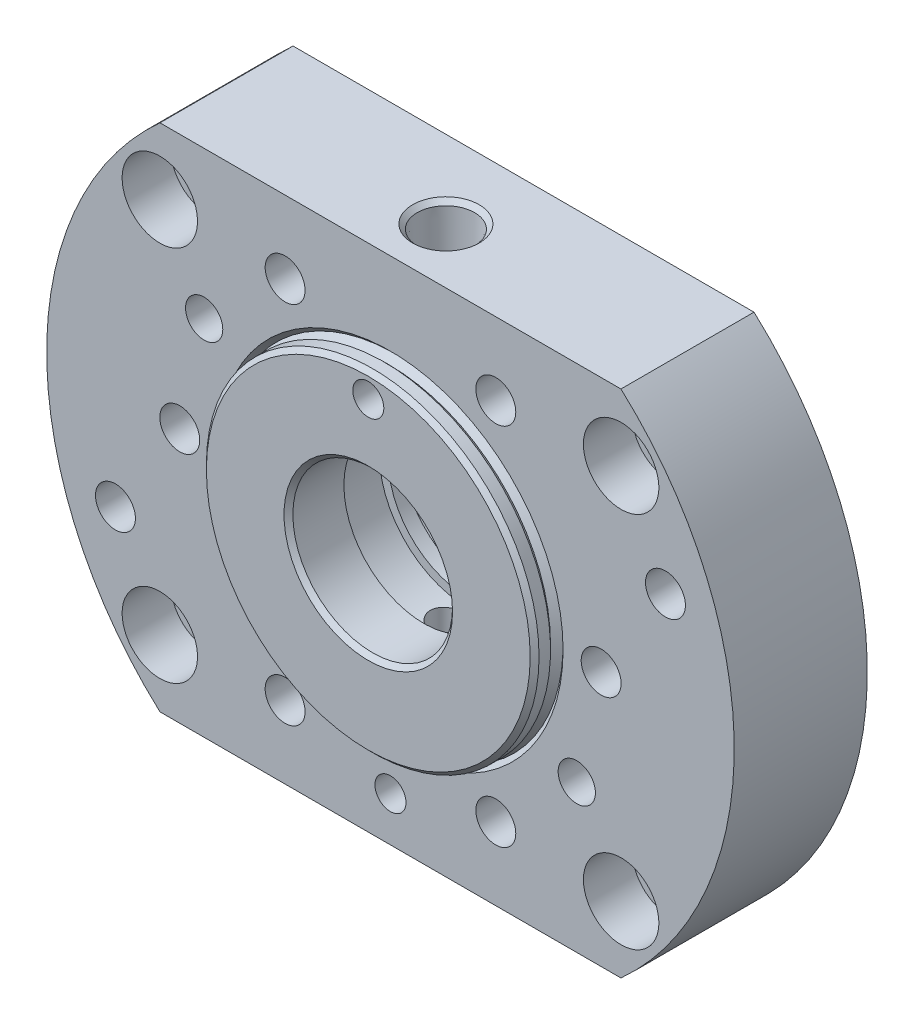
ISO-10303-21;
HEADER;
FILE_DESCRIPTION(('STEP AP214'),'2;1');
FILE_NAME('part.step','',(''),(''),'','','');
FILE_SCHEMA(('AUTOMOTIVE_DESIGN { 1 0 10303 214 1 1 1 1 }'));
ENDSEC;
DATA;
#1=APPLICATION_CONTEXT('core data for automotive mechanical design processes');
#2=APPLICATION_PROTOCOL_DEFINITION('international standard','automotive_design',2000,#1);
#3=PRODUCT_CONTEXT('',#1,'mechanical');
#4=PRODUCT('Part','Part','',(#3));
#5=PRODUCT_RELATED_PRODUCT_CATEGORY('part','',(#4));
#6=PRODUCT_DEFINITION_FORMATION('','',#4);
#7=PRODUCT_DEFINITION_CONTEXT('part definition',#1,'design');
#8=PRODUCT_DEFINITION('design','',#6,#7);
#9=PRODUCT_DEFINITION_SHAPE('','',#8);
#10=(LENGTH_UNIT() NAMED_UNIT(*) SI_UNIT(.MILLI.,.METRE.));
#11=(NAMED_UNIT(*) PLANE_ANGLE_UNIT() SI_UNIT($,.RADIAN.));
#12=(NAMED_UNIT(*) SI_UNIT($,.STERADIAN.) SOLID_ANGLE_UNIT());
#13=UNCERTAINTY_MEASURE_WITH_UNIT(LENGTH_MEASURE(1.E-05),#10,'distance_accuracy_value','');
#14=(GEOMETRIC_REPRESENTATION_CONTEXT(3) GLOBAL_UNCERTAINTY_ASSIGNED_CONTEXT((#13)) GLOBAL_UNIT_ASSIGNED_CONTEXT((#10,
#11,#12)) REPRESENTATION_CONTEXT('',''));
#15=CARTESIAN_POINT('',(0.,0.,0.));
#16=DIRECTION('',(0.,0.,1.));
#17=DIRECTION('',(1.,0.,0.));
#18=AXIS2_PLACEMENT_3D('',#15,#16,#17);
#19=CARTESIAN_POINT('',(0.,77.5,30.));
#20=DIRECTION('',(0.,0.,1.));
#21=DIRECTION('',(1.,0.,0.));
#22=AXIS2_PLACEMENT_3D('',#19,#20,#21);
#23=PLANE('',#22);
#24=CARTESIAN_POINT('',(-62.,-22.5,30.));
#25=DIRECTION('',(0.,0.,1.));
#26=DIRECTION('',(1.,0.,0.));
#27=AXIS2_PLACEMENT_3D('',#24,#25,#26);
#28=CIRCLE('',#27,4.5);
#29=CARTESIAN_POINT('',(-57.5,-22.5,30.));
#30=VERTEX_POINT('',#29);
#31=EDGE_CURVE('E902',#30,#30,#28,.T.);
#32=ORIENTED_EDGE('',*,*,#31,.F.);
#33=EDGE_LOOP('',(#32));
#34=FACE_BOUND('',#33,.T.);
#35=CARTESIAN_POINT('',(42.0022320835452,-24.2500000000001,30.));
#36=DIRECTION('',(0.,0.,1.));
#37=DIRECTION('',(1.,0.,0.));
#38=AXIS2_PLACEMENT_3D('',#35,#36,#37);
#39=CIRCLE('',#38,4.2);
#40=CARTESIAN_POINT('',(46.2022320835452,-24.2500000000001,30.));
#41=VERTEX_POINT('',#40);
#42=EDGE_CURVE('E905',#41,#41,#39,.T.);
#43=ORIENTED_EDGE('',*,*,#42,.F.);
#44=EDGE_LOOP('',(#43));
#45=FACE_BOUND('',#44,.T.);
#46=CARTESIAN_POINT('',(0.,-47.5,30.));
#47=DIRECTION('',(0.,0.,-1.));
#48=DIRECTION('',(0.,1.,0.));
#49=AXIS2_PLACEMENT_3D('',#46,#47,#48);
#50=CIRCLE('',#49,3.5);
#51=CARTESIAN_POINT('',(0.,-44.,30.));
#52=VERTEX_POINT('',#51);
#53=EDGE_CURVE('E124',#52,#52,#50,.T.);
#54=ORIENTED_EDGE('',*,*,#53,.T.);
#55=EDGE_LOOP('',(#54));
#56=FACE_BOUND('',#55,.T.);
#57=CARTESIAN_POINT('',(52.,-42.5,30.));
#58=DIRECTION('',(0.,0.,-1.));
#59=DIRECTION('',(-1.,0.,0.));
#60=AXIS2_PLACEMENT_3D('',#57,#58,#59);
#61=CIRCLE('',#60,8.5);
#62=CARTESIAN_POINT('',(43.5,-42.5,30.));
#63=VERTEX_POINT('',#62);
#64=EDGE_CURVE('E140',#63,#63,#61,.T.);
#65=ORIENTED_EDGE('',*,*,#64,.T.);
#66=EDGE_LOOP('',(#65));
#67=FACE_BOUND('',#66,.T.);
#68=CARTESIAN_POINT('',(-52.,42.5,30.));
#69=DIRECTION('',(0.,0.,-1.));
#70=DIRECTION('',(-1.,0.,0.));
#71=AXIS2_PLACEMENT_3D('',#68,#69,#70);
#72=CIRCLE('',#71,8.5);
#73=CARTESIAN_POINT('',(-60.5,42.5,30.));
#74=VERTEX_POINT('',#73);
#75=EDGE_CURVE('E154',#74,#74,#72,.T.);
#76=ORIENTED_EDGE('',*,*,#75,.T.);
#77=EDGE_LOOP('',(#76));
#78=FACE_BOUND('',#77,.T.);
#79=CARTESIAN_POINT('',(23.7500000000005,-41.1362066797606,30.));
#80=DIRECTION('',(0.,0.,1.));
#81=DIRECTION('',(1.,0.,0.));
#82=AXIS2_PLACEMENT_3D('',#79,#80,#81);
#83=CIRCLE('',#82,4.5);
#84=CARTESIAN_POINT('',(28.2500000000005,-41.1362066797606,30.));
#85=VERTEX_POINT('',#84);
#86=EDGE_CURVE('E388',#85,#85,#83,.T.);
#87=ORIENTED_EDGE('',*,*,#86,.F.);
#88=EDGE_LOOP('',(#87));
#89=FACE_BOUND('',#88,.T.);
#90=CARTESIAN_POINT('',(-23.7499999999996,-41.1362066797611,30.));
#91=DIRECTION('',(0.,0.,1.));
#92=DIRECTION('',(1.,0.,0.));
#93=AXIS2_PLACEMENT_3D('',#90,#91,#92);
#94=CIRCLE('',#93,4.5);
#95=CARTESIAN_POINT('',(-19.2499999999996,-41.1362066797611,30.));
#96=VERTEX_POINT('',#95);
#97=EDGE_CURVE('E385',#96,#96,#94,.T.);
#98=ORIENTED_EDGE('',*,*,#97,.F.);
#99=EDGE_LOOP('',(#98));
#100=FACE_BOUND('',#99,.T.);
#101=CARTESIAN_POINT('',(-47.5,-3.31690919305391E-13,30.));
#102=DIRECTION('',(0.,0.,1.));
#103=DIRECTION('',(1.,0.,0.));
#104=AXIS2_PLACEMENT_3D('',#101,#102,#103);
#105=CIRCLE('',#104,4.5);
#106=CARTESIAN_POINT('',(-43.,-3.31690919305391E-13,30.));
#107=VERTEX_POINT('',#106);
#108=EDGE_CURVE('E382',#107,#107,#105,.T.);
#109=ORIENTED_EDGE('',*,*,#108,.F.);
#110=EDGE_LOOP('',(#109));
#111=FACE_BOUND('',#110,.T.);
#112=CARTESIAN_POINT('',(-23.7500000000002,41.1362066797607,30.));
#113=DIRECTION('',(0.,0.,1.));
#114=DIRECTION('',(1.,0.,0.));
#115=AXIS2_PLACEMENT_3D('',#112,#113,#114);
#116=CIRCLE('',#115,4.5);
#117=CARTESIAN_POINT('',(-19.2500000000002,41.1362066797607,30.));
#118=VERTEX_POINT('',#117);
#119=EDGE_CURVE('E379',#118,#118,#116,.T.);
#120=ORIENTED_EDGE('',*,*,#119,.F.);
#121=EDGE_LOOP('',(#120));
#122=FACE_BOUND('',#121,.T.);
#123=CARTESIAN_POINT('',(23.7499999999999,41.1362066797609,30.));
#124=DIRECTION('',(0.,0.,1.));
#125=DIRECTION('',(1.,0.,0.));
#126=AXIS2_PLACEMENT_3D('',#123,#124,#125);
#127=CIRCLE('',#126,4.5);
#128=CARTESIAN_POINT('',(28.2499999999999,41.1362066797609,30.));
#129=VERTEX_POINT('',#128);
#130=EDGE_CURVE('E212',#129,#129,#127,.T.);
#131=ORIENTED_EDGE('',*,*,#130,.F.);
#132=EDGE_LOOP('',(#131));
#133=FACE_BOUND('',#132,.T.);
#134=CARTESIAN_POINT('',(47.5,0.,30.));
#135=DIRECTION('',(0.,0.,1.));
#136=DIRECTION('',(1.,0.,0.));
#137=AXIS2_PLACEMENT_3D('',#134,#135,#136);
#138=CIRCLE('',#137,4.5);
#139=CARTESIAN_POINT('',(52.,0.,30.));
#140=VERTEX_POINT('',#139);
#141=EDGE_CURVE('E220',#140,#140,#138,.T.);
#142=ORIENTED_EDGE('',*,*,#141,.F.);
#143=EDGE_LOOP('',(#142));
#144=FACE_BOUND('',#143,.T.);
#145=CARTESIAN_POINT('',(0.,0.,30.));
#146=DIRECTION('',(0.,0.,-1.));
#147=DIRECTION('',(-1.,0.,0.));
#148=AXIS2_PLACEMENT_3D('',#145,#146,#147);
#149=CIRCLE('',#148,38.9142135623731);
#150=CARTESIAN_POINT('',(-38.9142135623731,0.,30.));
#151=VERTEX_POINT('',#150);
#152=EDGE_CURVE('E307',#151,#151,#149,.T.);
#153=ORIENTED_EDGE('',*,*,#152,.T.);
#154=EDGE_LOOP('',(#153));
#155=FACE_BOUND('',#154,.T.);
#156=CARTESIAN_POINT('',(0.,0.,30.));
#157=DIRECTION('',(0.,0.,-1.));
#158=DIRECTION('',(-1.,0.,0.));
#159=AXIS2_PLACEMENT_3D('',#156,#157,#158);
#160=CIRCLE('',#159,77.5);
#161=CARTESIAN_POINT('',(-51.9615242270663,-57.5,30.));
#162=VERTEX_POINT('',#161);
#163=CARTESIAN_POINT('',(-51.9615242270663,57.5,30.));
#164=VERTEX_POINT('',#163);
#165=EDGE_CURVE('E310',#162,#164,#160,.T.);
#166=ORIENTED_EDGE('',*,*,#165,.F.);
#167=DIRECTION('',(1.,0.,0.));
#168=VECTOR('',#167,1.);
#169=CARTESIAN_POINT('',(0.,-57.5,30.));
#170=LINE('',#169,#168);
#171=CARTESIAN_POINT('',(51.9615242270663,-57.5,30.));
#172=VERTEX_POINT('',#171);
#173=EDGE_CURVE('E242',#162,#172,#170,.T.);
#174=ORIENTED_EDGE('',*,*,#173,.T.);
#175=CARTESIAN_POINT('',(51.9615242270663,57.5,30.));
#176=VERTEX_POINT('',#175);
#177=EDGE_CURVE('E311',#176,#172,#160,.T.);
#178=ORIENTED_EDGE('',*,*,#177,.F.);
#179=DIRECTION('',(-1.,0.,0.));
#180=VECTOR('',#179,1.);
#181=CARTESIAN_POINT('',(0.,57.5,30.));
#182=LINE('',#181,#180);
#183=EDGE_CURVE('E323',#176,#164,#182,.T.);
#184=ORIENTED_EDGE('',*,*,#183,.T.);
#185=EDGE_LOOP('',(#166,#174,#178,#184));
#186=FACE_BOUND('',#185,.T.);
#187=CARTESIAN_POINT('',(52.,42.5,30.));
#188=DIRECTION('',(0.,0.,-1.));
#189=DIRECTION('',(-1.,0.,0.));
#190=AXIS2_PLACEMENT_3D('',#187,#188,#189);
#191=CIRCLE('',#190,8.5);
#192=CARTESIAN_POINT('',(43.5,42.5,30.));
#193=VERTEX_POINT('',#192);
#194=EDGE_CURVE('E147',#193,#193,#191,.T.);
#195=ORIENTED_EDGE('',*,*,#194,.T.);
#196=EDGE_LOOP('',(#195));
#197=FACE_BOUND('',#196,.T.);
#198=CARTESIAN_POINT('',(-52.,-42.5,30.));
#199=DIRECTION('',(0.,0.,-1.));
#200=DIRECTION('',(-1.,0.,0.));
#201=AXIS2_PLACEMENT_3D('',#198,#199,#200);
#202=CIRCLE('',#201,8.5);
#203=CARTESIAN_POINT('',(-60.5,-42.5,30.));
#204=VERTEX_POINT('',#203);
#205=EDGE_CURVE('E133',#204,#204,#202,.T.);
#206=ORIENTED_EDGE('',*,*,#205,.T.);
#207=EDGE_LOOP('',(#206));
#208=FACE_BOUND('',#207,.T.);
#209=CARTESIAN_POINT('',(-42.0022320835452,24.2500000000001,30.));
#210=DIRECTION('',(0.,0.,1.));
#211=DIRECTION('',(1.,0.,0.));
#212=AXIS2_PLACEMENT_3D('',#209,#210,#211);
#213=CIRCLE('',#212,4.19999999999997);
#214=CARTESIAN_POINT('',(-37.8022320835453,24.2500000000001,30.));
#215=VERTEX_POINT('',#214);
#216=EDGE_CURVE('E911',#215,#215,#213,.T.);
#217=ORIENTED_EDGE('',*,*,#216,.F.);
#218=EDGE_LOOP('',(#217));
#219=FACE_BOUND('',#218,.T.);
#220=CARTESIAN_POINT('',(62.,22.5,30.));
#221=DIRECTION('',(0.,0.,-1.));
#222=DIRECTION('',(-1.,0.,0.));
#223=AXIS2_PLACEMENT_3D('',#220,#221,#222);
#224=CIRCLE('',#223,4.5);
#225=CARTESIAN_POINT('',(57.5,22.5,30.));
#226=VERTEX_POINT('',#225);
#227=EDGE_CURVE('E894',#226,#226,#224,.T.);
#228=ORIENTED_EDGE('',*,*,#227,.T.);
#229=EDGE_LOOP('',(#228));
#230=FACE_BOUND('',#229,.T.);
#231=ADVANCED_FACE('F41',(#34,#45,#56,#67,#78,#89,#100,#111,#122,#133,#144,#155,#186,#197,#208,
#219,#230),#23,.T.);
#232=CARTESIAN_POINT('',(0.,35.,0.));
#233=DIRECTION('',(0.,0.,-1.));
#234=DIRECTION('',(-1.,0.,0.));
#235=AXIS2_PLACEMENT_3D('',#232,#233,#234);
#236=PLANE('',#235);
#237=CARTESIAN_POINT('',(-62.,-22.5,0.));
#238=DIRECTION('',(0.,0.,1.));
#239=DIRECTION('',(1.,0.,0.));
#240=AXIS2_PLACEMENT_3D('',#237,#238,#239);
#241=CIRCLE('',#240,4.19999999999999);
#242=CARTESIAN_POINT('',(-57.8,-22.5,0.));
#243=VERTEX_POINT('',#242);
#244=EDGE_CURVE('E897',#243,#243,#241,.T.);
#245=ORIENTED_EDGE('',*,*,#244,.T.);
#246=EDGE_LOOP('',(#245));
#247=FACE_BOUND('',#246,.T.);
#248=CARTESIAN_POINT('',(42.0022320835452,-24.2500000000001,0.));
#249=DIRECTION('',(0.,0.,1.));
#250=DIRECTION('',(1.,0.,0.));
#251=AXIS2_PLACEMENT_3D('',#248,#249,#250);
#252=CIRCLE('',#251,4.49999999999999);
#253=CARTESIAN_POINT('',(46.5022320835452,-24.2500000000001,0.));
#254=VERTEX_POINT('',#253);
#255=EDGE_CURVE('E908',#254,#254,#252,.T.);
#256=ORIENTED_EDGE('',*,*,#255,.T.);
#257=EDGE_LOOP('',(#256));
#258=FACE_BOUND('',#257,.T.);
#259=CARTESIAN_POINT('',(23.7500000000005,-41.1362066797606,0.));
#260=DIRECTION('',(0.,0.,1.));
#261=DIRECTION('',(0.50000000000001,-0.866025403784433,0.));
#262=AXIS2_PLACEMENT_3D('',#259,#260,#261);
#263=CIRCLE('',#262,7.);
#264=CARTESIAN_POINT('',(27.2500000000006,-47.1983845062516,0.));
#265=VERTEX_POINT('',#264);
#266=EDGE_CURVE('E173',#265,#265,#263,.T.);
#267=ORIENTED_EDGE('',*,*,#266,.T.);
#268=EDGE_LOOP('',(#267));
#269=FACE_BOUND('',#268,.T.);
#270=CARTESIAN_POINT('',(-47.5,-3.31690919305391E-13,0.));
#271=DIRECTION('',(0.,0.,1.));
#272=DIRECTION('',(-1.,0.,0.));
#273=AXIS2_PLACEMENT_3D('',#270,#271,#272);
#274=CIRCLE('',#273,7.);
#275=CARTESIAN_POINT('',(-54.5,-3.80571686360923E-13,0.));
#276=VERTEX_POINT('',#275);
#277=EDGE_CURVE('E187',#276,#276,#274,.T.);
#278=ORIENTED_EDGE('',*,*,#277,.T.);
#279=EDGE_LOOP('',(#278));
#280=FACE_BOUND('',#279,.T.);
#281=CARTESIAN_POINT('',(23.7499999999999,41.1362066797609,0.));
#282=DIRECTION('',(0.,0.,1.));
#283=DIRECTION('',(0.499999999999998,0.86602540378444,0.));
#284=AXIS2_PLACEMENT_3D('',#281,#282,#283);
#285=CIRCLE('',#284,7.);
#286=CARTESIAN_POINT('',(27.2499999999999,47.198384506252,0.));
#287=VERTEX_POINT('',#286);
#288=EDGE_CURVE('E201',#287,#287,#285,.T.);
#289=ORIENTED_EDGE('',*,*,#288,.T.);
#290=EDGE_LOOP('',(#289));
#291=FACE_BOUND('',#290,.T.);
#292=CARTESIAN_POINT('',(0.,0.,0.));
#293=DIRECTION('',(0.,0.,-1.));
#294=DIRECTION('',(-1.,0.,0.));
#295=AXIS2_PLACEMENT_3D('',#292,#293,#294);
#296=CIRCLE('',#295,77.5);
#297=CARTESIAN_POINT('',(51.9615242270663,57.5,0.));
#298=VERTEX_POINT('',#297);
#299=CARTESIAN_POINT('',(51.9615242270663,-57.5,0.));
#300=VERTEX_POINT('',#299);
#301=EDGE_CURVE('E314',#298,#300,#296,.T.);
#302=ORIENTED_EDGE('',*,*,#301,.T.);
#303=DIRECTION('',(-1.,0.,0.));
#304=VECTOR('',#303,1.);
#305=CARTESIAN_POINT('',(-96.0450463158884,-57.5,0.));
#306=LINE('',#305,#304);
#307=CARTESIAN_POINT('',(2.49999999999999,-57.5,0.));
#308=VERTEX_POINT('',#307);
#309=EDGE_CURVE('E237',#300,#308,#306,.T.);
#310=ORIENTED_EDGE('',*,*,#309,.T.);
#311=DIRECTION('',(0.,-1.,0.));
#312=VECTOR('',#311,1.);
#313=CARTESIAN_POINT('',(2.5,-27.7392203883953,0.));
#314=LINE('',#313,#312);
#315=CARTESIAN_POINT('',(2.5,-34.9106001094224,0.));
#316=VERTEX_POINT('',#315);
#317=EDGE_CURVE('E264',#316,#308,#314,.T.);
#318=ORIENTED_EDGE('',*,*,#317,.F.);
#319=CARTESIAN_POINT('',(0.,0.,0.));
#320=DIRECTION('',(0.,0.,-1.));
#321=DIRECTION('',(-1.,0.,0.));
#322=AXIS2_PLACEMENT_3D('',#319,#320,#321);
#323=CIRCLE('',#322,35.);
#324=CARTESIAN_POINT('',(-2.5,-34.9106001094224,0.));
#325=VERTEX_POINT('',#324);
#326=EDGE_CURVE('E317',#325,#316,#323,.T.);
#327=ORIENTED_EDGE('',*,*,#326,.F.);
#328=DIRECTION('',(0.,1.,0.));
#329=VECTOR('',#328,1.);
#330=CARTESIAN_POINT('',(-2.5,-27.7392203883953,0.));
#331=LINE('',#330,#329);
#332=CARTESIAN_POINT('',(-2.5,-57.5,0.));
#333=VERTEX_POINT('',#332);
#334=EDGE_CURVE('E260',#333,#325,#331,.T.);
#335=ORIENTED_EDGE('',*,*,#334,.F.);
#336=CARTESIAN_POINT('',(-51.9615242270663,-57.5,0.));
#337=VERTEX_POINT('',#336);
#338=EDGE_CURVE('E234',#333,#337,#306,.T.);
#339=ORIENTED_EDGE('',*,*,#338,.T.);
#340=CARTESIAN_POINT('',(-51.9615242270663,57.5,0.));
#341=VERTEX_POINT('',#340);
#342=EDGE_CURVE('E315',#337,#341,#296,.T.);
#343=ORIENTED_EDGE('',*,*,#342,.T.);
#344=DIRECTION('',(1.,0.,0.));
#345=VECTOR('',#344,1.);
#346=CARTESIAN_POINT('',(-96.0450463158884,57.5,0.));
#347=LINE('',#346,#345);
#348=EDGE_CURVE('E251',#341,#298,#347,.T.);
#349=ORIENTED_EDGE('',*,*,#348,.T.);
#350=EDGE_LOOP('',(#302,#310,#318,#327,#335,#339,#343,#349));
#351=FACE_BOUND('',#350,.T.);
#352=CARTESIAN_POINT('',(47.5,0.,0.));
#353=DIRECTION('',(0.,0.,1.));
#354=DIRECTION('',(1.,0.,0.));
#355=AXIS2_PLACEMENT_3D('',#352,#353,#354);
#356=CIRCLE('',#355,7.);
#357=CARTESIAN_POINT('',(54.5,0.,0.));
#358=VERTEX_POINT('',#357);
#359=EDGE_CURVE('E208',#358,#358,#356,.T.);
#360=ORIENTED_EDGE('',*,*,#359,.T.);
#361=EDGE_LOOP('',(#360));
#362=FACE_BOUND('',#361,.T.);
#363=CARTESIAN_POINT('',(-23.7500000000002,41.1362066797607,0.));
#364=DIRECTION('',(0.,0.,1.));
#365=DIRECTION('',(-0.500000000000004,0.866025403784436,0.));
#366=AXIS2_PLACEMENT_3D('',#363,#364,#365);
#367=CIRCLE('',#366,7.);
#368=CARTESIAN_POINT('',(-27.2500000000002,47.1983845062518,0.));
#369=VERTEX_POINT('',#368);
#370=EDGE_CURVE('E194',#369,#369,#367,.T.);
#371=ORIENTED_EDGE('',*,*,#370,.T.);
#372=EDGE_LOOP('',(#371));
#373=FACE_BOUND('',#372,.T.);
#374=CARTESIAN_POINT('',(-23.7499999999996,-41.1362066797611,0.));
#375=DIRECTION('',(0.,0.,1.));
#376=DIRECTION('',(-0.499999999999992,-0.866025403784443,0.));
#377=AXIS2_PLACEMENT_3D('',#374,#375,#376);
#378=CIRCLE('',#377,7.);
#379=CARTESIAN_POINT('',(-27.2499999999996,-47.1983845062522,0.));
#380=VERTEX_POINT('',#379);
#381=EDGE_CURVE('E180',#380,#380,#378,.T.);
#382=ORIENTED_EDGE('',*,*,#381,.T.);
#383=EDGE_LOOP('',(#382));
#384=FACE_BOUND('',#383,.T.);
#385=CARTESIAN_POINT('',(-52.,42.5,0.));
#386=DIRECTION('',(0.,0.,-1.));
#387=DIRECTION('',(-1.,0.,0.));
#388=AXIS2_PLACEMENT_3D('',#385,#386,#387);
#389=CIRCLE('',#388,5.5);
#390=CARTESIAN_POINT('',(-57.5,42.5,0.));
#391=VERTEX_POINT('',#390);
#392=EDGE_CURVE('E170',#391,#391,#389,.T.);
#393=ORIENTED_EDGE('',*,*,#392,.F.);
#394=EDGE_LOOP('',(#393));
#395=FACE_BOUND('',#394,.T.);
#396=CARTESIAN_POINT('',(52.,42.5,0.));
#397=DIRECTION('',(0.,0.,-1.));
#398=DIRECTION('',(-1.,0.,0.));
#399=AXIS2_PLACEMENT_3D('',#396,#397,#398);
#400=CIRCLE('',#399,5.5);
#401=CARTESIAN_POINT('',(46.5,42.5,0.));
#402=VERTEX_POINT('',#401);
#403=EDGE_CURVE('E167',#402,#402,#400,.T.);
#404=ORIENTED_EDGE('',*,*,#403,.F.);
#405=EDGE_LOOP('',(#404));
#406=FACE_BOUND('',#405,.T.);
#407=CARTESIAN_POINT('',(52.,-42.5,0.));
#408=DIRECTION('',(0.,0.,-1.));
#409=DIRECTION('',(-1.,0.,0.));
#410=AXIS2_PLACEMENT_3D('',#407,#408,#409);
#411=CIRCLE('',#410,5.5);
#412=CARTESIAN_POINT('',(46.5,-42.5,0.));
#413=VERTEX_POINT('',#412);
#414=EDGE_CURVE('E164',#413,#413,#411,.T.);
#415=ORIENTED_EDGE('',*,*,#414,.F.);
#416=EDGE_LOOP('',(#415));
#417=FACE_BOUND('',#416,.T.);
#418=CARTESIAN_POINT('',(-52.,-42.5,0.));
#419=DIRECTION('',(0.,0.,-1.));
#420=DIRECTION('',(-1.,0.,0.));
#421=AXIS2_PLACEMENT_3D('',#418,#419,#420);
#422=CIRCLE('',#421,5.5);
#423=CARTESIAN_POINT('',(-57.5,-42.5,0.));
#424=VERTEX_POINT('',#423);
#425=EDGE_CURVE('E161',#424,#424,#422,.T.);
#426=ORIENTED_EDGE('',*,*,#425,.F.);
#427=EDGE_LOOP('',(#426));
#428=FACE_BOUND('',#427,.T.);
#429=CARTESIAN_POINT('',(-42.0022320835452,24.2500000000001,0.));
#430=DIRECTION('',(0.,0.,1.));
#431=DIRECTION('',(1.,0.,0.));
#432=AXIS2_PLACEMENT_3D('',#429,#430,#431);
#433=CIRCLE('',#432,4.5);
#434=CARTESIAN_POINT('',(-37.5022320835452,24.2500000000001,0.));
#435=VERTEX_POINT('',#434);
#436=EDGE_CURVE('E128',#435,#435,#433,.T.);
#437=ORIENTED_EDGE('',*,*,#436,.T.);
#438=EDGE_LOOP('',(#437));
#439=FACE_BOUND('',#438,.T.);
#440=CARTESIAN_POINT('',(62.,22.5,0.));
#441=DIRECTION('',(0.,0.,-1.));
#442=DIRECTION('',(-1.,0.,0.));
#443=AXIS2_PLACEMENT_3D('',#440,#441,#442);
#444=CIRCLE('',#443,4.19999999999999);
#445=CARTESIAN_POINT('',(57.8,22.5,0.));
#446=VERTEX_POINT('',#445);
#447=EDGE_CURVE('E893',#446,#446,#444,.T.);
#448=ORIENTED_EDGE('',*,*,#447,.F.);
#449=EDGE_LOOP('',(#448));
#450=FACE_BOUND('',#449,.T.);
#451=ADVANCED_FACE('F442',(#247,#258,#269,#280,#291,#351,#362,#373,#384,#395,#406,#417,#428,
#439,#450),#236,.T.);
#452=CARTESIAN_POINT('',(0.,70.5588959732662,17.5));
#453=DIRECTION('',(0.,1.,0.));
#454=DIRECTION('',(0.,0.,1.));
#455=AXIS2_PLACEMENT_3D('',#452,#453,#454);
#456=CYLINDRICAL_SURFACE('',#455,3.5);
#457=CARTESIAN_POINT('',(0.,-20.,21.));
#458=CARTESIAN_POINT('',(-0.195000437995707,-19.9999965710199,20.9999923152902));
#459=CARTESIAN_POINT('',(-0.390103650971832,-19.9971185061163,20.9836484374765));
#460=CARTESIAN_POINT('',(-0.774828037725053,-19.9859145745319,20.918737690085));
#461=CARTESIAN_POINT('',(-0.964444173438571,-19.9775838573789,20.8701421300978));
#462=CARTESIAN_POINT('',(-1.33257343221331,-19.9564080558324,20.7422485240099));
#463=CARTESIAN_POINT('',(-1.51109585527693,-19.9435668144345,20.6629766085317));
#464=CARTESIAN_POINT('',(-1.85228595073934,-19.914778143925,20.476051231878));
#465=CARTESIAN_POINT('',(-2.01495522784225,-19.8988310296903,20.3684006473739));
#466=CARTESIAN_POINT('',(-2.32154916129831,-19.8654083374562,20.1265727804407));
#467=CARTESIAN_POINT('',(-2.46528329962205,-19.8479198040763,19.9921557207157));
#468=CARTESIAN_POINT('',(-2.72828019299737,-19.813483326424,19.7011265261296));
#469=CARTESIAN_POINT('',(-2.847541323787,-19.7965354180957,19.5445129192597));
#470=CARTESIAN_POINT('',(-3.05898159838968,-19.7649735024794,19.212212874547));
#471=CARTESIAN_POINT('',(-3.15097024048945,-19.750376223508,19.0364034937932));
#472=CARTESIAN_POINT('',(-3.30403560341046,-19.7253492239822,18.6715292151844));
#473=CARTESIAN_POINT('',(-3.36511463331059,-19.7149191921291,18.4824653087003));
#474=CARTESIAN_POINT('',(-3.4540223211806,-19.6995371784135,18.0984759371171));
#475=CARTESIAN_POINT('',(-3.48218122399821,-19.6945308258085,17.9036291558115));
#476=CARTESIAN_POINT('',(-3.50547370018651,-19.6903987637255,17.5119170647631));
#477=CARTESIAN_POINT('',(-3.50060985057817,-19.6912725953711,17.3150519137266));
#478=CARTESIAN_POINT('',(-3.45826341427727,-19.6987525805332,16.9272622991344));
#479=CARTESIAN_POINT('',(-3.42115355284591,-19.7052932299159,16.7362956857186));
#480=CARTESIAN_POINT('',(-3.3159542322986,-19.7232672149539,16.3633415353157));
#481=CARTESIAN_POINT('',(-3.24786361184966,-19.7347007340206,16.181354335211));
#482=CARTESIAN_POINT('',(-3.0822629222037,-19.7612420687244,15.8304189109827));
#483=CARTESIAN_POINT('',(-2.98459973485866,-19.7763689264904,15.6615444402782));
#484=CARTESIAN_POINT('',(-2.76273475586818,-19.8085795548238,15.3424392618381));
#485=CARTESIAN_POINT('',(-2.63853060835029,-19.8256634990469,15.1922102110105));
#486=CARTESIAN_POINT('',(-2.36508680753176,-19.86015027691,14.9125043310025));
#487=CARTESIAN_POINT('',(-2.21552773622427,-19.8775542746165,14.7833397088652));
#488=CARTESIAN_POINT('',(-1.89669536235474,-19.9105045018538,14.5518901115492));
#489=CARTESIAN_POINT('',(-1.72742190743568,-19.9260507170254,14.4496053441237));
#490=CARTESIAN_POINT('',(-1.3736598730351,-19.9535592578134,14.2747837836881));
#491=CARTESIAN_POINT('',(-1.18915643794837,-19.9655180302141,14.202276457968));
#492=CARTESIAN_POINT('',(-0.810333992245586,-19.9844761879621,14.0893677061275));
#493=CARTESIAN_POINT('',(-0.616015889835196,-19.9914760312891,14.0489633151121));
#494=CARTESIAN_POINT('',(-0.225769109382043,-19.9996655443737,14.0018349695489));
#495=CARTESIAN_POINT('',(-0.029893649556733,-20.0009290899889,13.9946827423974));
#496=CARTESIAN_POINT('',(0.360255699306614,-19.9977066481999,14.0131172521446));
#497=CARTESIAN_POINT('',(0.554529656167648,-19.9932209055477,14.0387025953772));
#498=CARTESIAN_POINT('',(0.934624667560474,-19.9790497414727,14.1215297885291));
#499=CARTESIAN_POINT('',(1.12049374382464,-19.969399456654,14.1785577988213));
#500=CARTESIAN_POINT('',(1.48003298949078,-19.9459767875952,14.3224222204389));
#501=CARTESIAN_POINT('',(1.65370241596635,-19.9322041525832,14.409260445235));
#502=CARTESIAN_POINT('',(1.98576028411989,-19.9018806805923,14.6112483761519));
#503=CARTESIAN_POINT('',(2.14398498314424,-19.885304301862,14.7266633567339));
#504=CARTESIAN_POINT('',(2.43897402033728,-19.8512844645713,14.9821660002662));
#505=CARTESIAN_POINT('',(2.57573662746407,-19.8338409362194,15.1222556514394));
#506=CARTESIAN_POINT('',(2.82552229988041,-19.799811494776,15.4250589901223));
#507=CARTESIAN_POINT('',(2.93825484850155,-19.7832377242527,15.5880139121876));
#508=CARTESIAN_POINT('',(3.13474614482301,-19.7530577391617,15.9307996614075));
#509=CARTESIAN_POINT('',(3.21850587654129,-19.7394514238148,16.1106299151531));
#510=CARTESIAN_POINT('',(3.35424807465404,-19.7168396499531,16.4812782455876));
#511=CARTESIAN_POINT('',(3.40637071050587,-19.7078139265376,16.6720436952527));
#512=CARTESIAN_POINT('',(3.4777970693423,-19.6953361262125,17.0597946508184));
#513=CARTESIAN_POINT('',(3.49710396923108,-19.6918835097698,17.2567795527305));
#514=CARTESIAN_POINT('',(3.50225530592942,-19.6909677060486,17.6484734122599));
#515=CARTESIAN_POINT('',(3.48855737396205,-19.6934226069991,17.843176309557));
#516=CARTESIAN_POINT('',(3.42908220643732,-19.7038648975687,18.2274602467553));
#517=CARTESIAN_POINT('',(3.38330510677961,-19.7118522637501,18.4170413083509));
#518=CARTESIAN_POINT('',(3.26115335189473,-19.7324270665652,18.7854962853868));
#519=CARTESIAN_POINT('',(3.18482204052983,-19.745007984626,18.9643849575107));
#520=CARTESIAN_POINT('',(3.00377671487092,-19.7733579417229,19.3068908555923));
#521=CARTESIAN_POINT('',(2.8990610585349,-19.7891271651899,19.4705071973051));
#522=CARTESIAN_POINT('',(2.66260253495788,-19.8223345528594,19.7801285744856));
#523=CARTESIAN_POINT('',(2.53052435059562,-19.8397918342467,19.9258755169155));
#524=CARTESIAN_POINT('',(2.24379443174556,-19.8742595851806,20.1932924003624));
#525=CARTESIAN_POINT('',(2.08913750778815,-19.8912699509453,20.31495679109));
#526=CARTESIAN_POINT('',(1.76022037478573,-19.9230797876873,20.5316188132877));
#527=CARTESIAN_POINT('',(1.58581845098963,-19.9378612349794,20.6264039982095));
#528=CARTESIAN_POINT('',(1.22337325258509,-19.9633723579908,20.7851825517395));
#529=CARTESIAN_POINT('',(1.03534347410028,-19.9741059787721,20.8492059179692));
#530=CARTESIAN_POINT('',(0.705540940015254,-19.988028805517,20.9310911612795));
#531=CARTESIAN_POINT('',(0.565738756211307,-19.9924934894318,20.9568895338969));
#532=CARTESIAN_POINT('',(0.283975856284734,-19.9984803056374,20.9913465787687));
#533=CARTESIAN_POINT('',(0.142015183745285,-20.0000024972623,21.0000055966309));
#534=CARTESIAN_POINT('',(0.,-20.,21.));
#535=B_SPLINE_CURVE_WITH_KNOTS('',3,(#457,#458,#459,#460,#461,#462,#463,#464,#465,#466,#467,
#468,#469,#470,#471,#472,#473,#474,#475,#476,#477,#478,#479,#480,#481,#482,#483,#484,#485,#486,
#487,#488,#489,#490,#491,#492,#493,#494,#495,#496,#497,#498,#499,#500,#501,#502,#503,#504,#505,
#506,#507,#508,#509,#510,#511,#512,#513,#514,#515,#516,#517,#518,#519,#520,#521,#522,#523,#524,
#525,#526,#527,#528,#529,#530,#531,#532,#533,#534),.UNSPECIFIED.,.T.,.F.,(4,2,2,2,2,2,2,2,2,2,2,
2,2,2,2,2,2,2,2,2,2,2,2,2,2,2,2,2,2,2,2,2,2,2,2,2,2,2,4),(0.,0.584482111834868,1.16948486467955,
1.75399039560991,2.33843669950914,2.92837532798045,3.51835309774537,4.11235976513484,
4.70632205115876,5.29427331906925,5.88217870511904,6.46337766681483,7.04459841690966,
7.62888156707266,8.21321660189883,8.80555009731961,9.39788817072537,9.99081100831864,
10.5836790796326,11.1688897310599,11.7540754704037,12.3353296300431,12.916619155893,
13.5035215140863,14.0904711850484,14.684158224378,15.2778250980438,15.868842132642,
16.4598019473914,17.042615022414,17.6254256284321,18.2074123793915,18.7894328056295,
19.3790592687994,19.9688214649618,20.5631227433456,21.1568433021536,21.5825193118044,
22.0081867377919),.UNSPECIFIED.);
#536=CARTESIAN_POINT('',(0.,-20.,21.));
#537=VERTEX_POINT('',#536);
#538=EDGE_CURVE('E238',#537,#537,#535,.T.);
#539=ORIENTED_EDGE('',*,*,#538,.F.);
#540=EDGE_LOOP('',(#539));
#541=FACE_BOUND('',#540,.T.);
#542=CARTESIAN_POINT('',(0.,-47.5,17.5));
#543=DIRECTION('',(0.,0.707106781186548,0.707106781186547));
#544=DIRECTION('',(0.,0.707106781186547,-0.707106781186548));
#545=AXIS2_PLACEMENT_3D('',#542,#543,#544);
#546=ELLIPSE('',#545,4.94974746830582,3.5);
#547=CARTESIAN_POINT('',(-3.49999999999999,-47.5,17.5));
#548=VERTEX_POINT('',#547);
#549=CARTESIAN_POINT('',(3.49999999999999,-47.5,17.5));
#550=VERTEX_POINT('',#549);
#551=EDGE_CURVE('E123',#548,#550,#546,.F.);
#552=ORIENTED_EDGE('',*,*,#551,.T.);
#553=CARTESIAN_POINT('',(0.,-47.5,17.5));
#554=DIRECTION('',(0.,0.707106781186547,-0.707106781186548));
#555=DIRECTION('',(0.,0.707106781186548,0.707106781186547));
#556=AXIS2_PLACEMENT_3D('',#553,#554,#555);
#557=ELLIPSE('',#556,4.94974746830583,3.5);
#558=EDGE_CURVE('E55',#550,#548,#557,.F.);
#559=ORIENTED_EDGE('',*,*,#558,.T.);
#560=EDGE_LOOP('',(#552,#559));
#561=FACE_BOUND('',#560,.T.);
#562=ADVANCED_FACE('F350',(#541,#561),#456,.F.);
#563=CARTESIAN_POINT('',(0.,0.,0.));
#564=DIRECTION('',(0.,0.,-1.));
#565=DIRECTION('',(-1.,0.,0.));
#566=AXIS2_PLACEMENT_3D('',#563,#564,#565);
#567=CYLINDRICAL_SURFACE('',#566,20.);
#568=CARTESIAN_POINT('',(0.,20.,21.));
#569=CARTESIAN_POINT('',(0.195000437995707,19.9999965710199,20.9999923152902));
#570=CARTESIAN_POINT('',(0.390103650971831,19.9971185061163,20.9836484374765));
#571=CARTESIAN_POINT('',(0.774828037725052,19.9859145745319,20.918737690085));
#572=CARTESIAN_POINT('',(0.964444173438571,19.9775838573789,20.8701421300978));
#573=CARTESIAN_POINT('',(1.33257343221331,19.9564080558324,20.7422485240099));
#574=CARTESIAN_POINT('',(1.51109585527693,19.9435668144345,20.6629766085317));
#575=CARTESIAN_POINT('',(1.85228595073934,19.914778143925,20.476051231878));
#576=CARTESIAN_POINT('',(2.01495522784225,19.8988310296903,20.368400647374));
#577=CARTESIAN_POINT('',(2.32154916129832,19.8654083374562,20.1265727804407));
#578=CARTESIAN_POINT('',(2.46528329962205,19.8479198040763,19.9921557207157));
#579=CARTESIAN_POINT('',(2.72828019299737,19.813483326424,19.7011265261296));
#580=CARTESIAN_POINT('',(2.847541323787,19.7965354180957,19.5445129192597));
#581=CARTESIAN_POINT('',(3.05898159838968,19.7649735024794,19.212212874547));
#582=CARTESIAN_POINT('',(3.15097024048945,19.750376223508,19.0364034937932));
#583=CARTESIAN_POINT('',(3.30403560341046,19.7253492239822,18.6715292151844));
#584=CARTESIAN_POINT('',(3.36511463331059,19.7149191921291,18.4824653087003));
#585=CARTESIAN_POINT('',(3.4540223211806,19.6995371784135,18.0984759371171));
#586=CARTESIAN_POINT('',(3.48218122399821,19.6945308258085,17.9036291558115));
#587=CARTESIAN_POINT('',(3.50547370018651,19.6903987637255,17.5119170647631));
#588=CARTESIAN_POINT('',(3.50060985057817,19.6912725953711,17.3150519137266));
#589=CARTESIAN_POINT('',(3.45826341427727,19.6987525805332,16.9272622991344));
#590=CARTESIAN_POINT('',(3.42115355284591,19.7052932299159,16.7362956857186));
#591=CARTESIAN_POINT('',(3.3159542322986,19.7232672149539,16.3633415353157));
#592=CARTESIAN_POINT('',(3.24786361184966,19.7347007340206,16.181354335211));
#593=CARTESIAN_POINT('',(3.08226292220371,19.7612420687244,15.8304189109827));
#594=CARTESIAN_POINT('',(2.98459973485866,19.7763689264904,15.6615444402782));
#595=CARTESIAN_POINT('',(2.76273475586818,19.8085795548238,15.3424392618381));
#596=CARTESIAN_POINT('',(2.63853060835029,19.8256634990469,15.1922102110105));
#597=CARTESIAN_POINT('',(2.36508680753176,19.86015027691,14.9125043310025));
#598=CARTESIAN_POINT('',(2.21552773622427,19.8775542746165,14.7833397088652));
#599=CARTESIAN_POINT('',(1.89669536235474,19.9105045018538,14.5518901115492));
#600=CARTESIAN_POINT('',(1.72742190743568,19.9260507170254,14.4496053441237));
#601=CARTESIAN_POINT('',(1.3736598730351,19.9535592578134,14.2747837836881));
#602=CARTESIAN_POINT('',(1.18915643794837,19.9655180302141,14.202276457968));
#603=CARTESIAN_POINT('',(0.810333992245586,19.9844761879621,14.0893677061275));
#604=CARTESIAN_POINT('',(0.616015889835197,19.9914760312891,14.0489633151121));
#605=CARTESIAN_POINT('',(0.225769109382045,19.9996655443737,14.0018349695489));
#606=CARTESIAN_POINT('',(0.0298936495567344,20.0009290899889,13.9946827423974));
#607=CARTESIAN_POINT('',(-0.360255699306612,19.9977066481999,14.0131172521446));
#608=CARTESIAN_POINT('',(-0.554529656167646,19.9932209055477,14.0387025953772));
#609=CARTESIAN_POINT('',(-0.934624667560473,19.9790497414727,14.1215297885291));
#610=CARTESIAN_POINT('',(-1.12049374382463,19.969399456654,14.1785577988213));
#611=CARTESIAN_POINT('',(-1.48003298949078,19.9459767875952,14.3224222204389));
#612=CARTESIAN_POINT('',(-1.65370241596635,19.9322041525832,14.409260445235));
#613=CARTESIAN_POINT('',(-1.98576028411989,19.9018806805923,14.6112483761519));
#614=CARTESIAN_POINT('',(-2.14398498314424,19.885304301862,14.726663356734));
#615=CARTESIAN_POINT('',(-2.43897402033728,19.8512844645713,14.9821660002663));
#616=CARTESIAN_POINT('',(-2.57573662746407,19.8338409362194,15.1222556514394));
#617=CARTESIAN_POINT('',(-2.82552229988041,19.799811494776,15.4250589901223));
#618=CARTESIAN_POINT('',(-2.93825484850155,19.7832377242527,15.5880139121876));
#619=CARTESIAN_POINT('',(-3.13474614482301,19.7530577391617,15.9307996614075));
#620=CARTESIAN_POINT('',(-3.21850587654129,19.7394514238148,16.1106299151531));
#621=CARTESIAN_POINT('',(-3.35424807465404,19.7168396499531,16.4812782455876));
#622=CARTESIAN_POINT('',(-3.40637071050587,19.7078139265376,16.6720436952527));
#623=CARTESIAN_POINT('',(-3.4777970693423,19.6953361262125,17.0597946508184));
#624=CARTESIAN_POINT('',(-3.49710396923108,19.6918835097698,17.2567795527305));
#625=CARTESIAN_POINT('',(-3.50225530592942,19.6909677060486,17.6484734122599));
#626=CARTESIAN_POINT('',(-3.48855737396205,19.6934226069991,17.843176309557));
#627=CARTESIAN_POINT('',(-3.42908220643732,19.7038648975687,18.2274602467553));
#628=CARTESIAN_POINT('',(-3.38330510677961,19.7118522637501,18.4170413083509));
#629=CARTESIAN_POINT('',(-3.26115335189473,19.7324270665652,18.7854962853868));
#630=CARTESIAN_POINT('',(-3.18482204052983,19.745007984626,18.9643849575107));
#631=CARTESIAN_POINT('',(-3.00377671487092,19.7733579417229,19.3068908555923));
#632=CARTESIAN_POINT('',(-2.8990610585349,19.7891271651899,19.4705071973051));
#633=CARTESIAN_POINT('',(-2.66260253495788,19.8223345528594,19.7801285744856));
#634=CARTESIAN_POINT('',(-2.53052435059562,19.8397918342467,19.9258755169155));
#635=CARTESIAN_POINT('',(-2.24379443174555,19.8742595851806,20.1932924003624));
#636=CARTESIAN_POINT('',(-2.08913750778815,19.8912699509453,20.31495679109));
#637=CARTESIAN_POINT('',(-1.76022037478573,19.9230797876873,20.5316188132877));
#638=CARTESIAN_POINT('',(-1.58581845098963,19.9378612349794,20.6264039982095));
#639=CARTESIAN_POINT('',(-1.22337325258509,19.9633723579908,20.7851825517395));
#640=CARTESIAN_POINT('',(-1.03534347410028,19.9741059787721,20.8492059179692));
#641=CARTESIAN_POINT('',(-0.705540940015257,19.988028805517,20.9310911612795));
#642=CARTESIAN_POINT('',(-0.56573875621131,19.9924934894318,20.9568895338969));
#643=CARTESIAN_POINT('',(-0.283975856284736,19.9984803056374,20.9913465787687));
#644=CARTESIAN_POINT('',(-0.142015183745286,20.0000024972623,21.0000055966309));
#645=CARTESIAN_POINT('',(0.,20.,21.));
#646=B_SPLINE_CURVE_WITH_KNOTS('',3,(#568,#569,#570,#571,#572,#573,#574,#575,#576,#577,#578,
#579,#580,#581,#582,#583,#584,#585,#586,#587,#588,#589,#590,#591,#592,#593,#594,#595,#596,#597,
#598,#599,#600,#601,#602,#603,#604,#605,#606,#607,#608,#609,#610,#611,#612,#613,#614,#615,#616,
#617,#618,#619,#620,#621,#622,#623,#624,#625,#626,#627,#628,#629,#630,#631,#632,#633,#634,#635,
#636,#637,#638,#639,#640,#641,#642,#643,#644,#645),.UNSPECIFIED.,.T.,.F.,(4,2,2,2,2,2,2,2,2,2,2,
2,2,2,2,2,2,2,2,2,2,2,2,2,2,2,2,2,2,2,2,2,2,2,2,2,2,2,4),(0.,0.584482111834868,1.16948486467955,
1.75399039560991,2.33843669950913,2.92837532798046,3.51835309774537,4.11235976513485,
4.70632205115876,5.29427331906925,5.88217870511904,6.46337766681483,7.04459841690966,
7.62888156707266,8.21321660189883,8.80555009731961,9.39788817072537,9.99081100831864,
10.5836790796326,11.1688897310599,11.7540754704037,12.3353296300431,12.916619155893,
13.5035215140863,14.0904711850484,14.684158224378,15.2778250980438,15.868842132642,
16.4598019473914,17.042615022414,17.6254256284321,18.2074123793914,18.7894328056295,
19.3790592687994,19.9688214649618,20.5631227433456,21.1568433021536,21.5825193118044,
22.0081867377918),.UNSPECIFIED.);
#647=CARTESIAN_POINT('',(0.,20.,21.));
#648=VERTEX_POINT('',#647);
#649=EDGE_CURVE('E233',#648,#648,#646,.T.);
#650=ORIENTED_EDGE('',*,*,#649,.T.);
#651=EDGE_LOOP('',(#650));
#652=FACE_BOUND('',#651,.T.);
#653=CARTESIAN_POINT('',(0.,0.,12.5));
#654=DIRECTION('',(0.,0.,-1.));
#655=DIRECTION('',(-1.,0.,0.));
#656=AXIS2_PLACEMENT_3D('',#653,#654,#655);
#657=CIRCLE('',#656,20.);
#658=CARTESIAN_POINT('',(-20.,0.,12.5));
#659=VERTEX_POINT('',#658);
#660=EDGE_CURVE('E289',#659,#659,#657,.T.);
#661=ORIENTED_EDGE('',*,*,#660,.T.);
#662=EDGE_LOOP('',(#661));
#663=FACE_BOUND('',#662,.T.);
#664=CARTESIAN_POINT('',(0.,0.,22.5));
#665=DIRECTION('',(0.,0.,-1.));
#666=DIRECTION('',(-1.,0.,0.));
#667=AXIS2_PLACEMENT_3D('',#664,#665,#666);
#668=CIRCLE('',#667,20.);
#669=CARTESIAN_POINT('',(-20.,0.,22.5));
#670=VERTEX_POINT('',#669);
#671=EDGE_CURVE('E292',#670,#670,#668,.T.);
#672=ORIENTED_EDGE('',*,*,#671,.F.);
#673=EDGE_LOOP('',(#672));
#674=FACE_BOUND('',#673,.T.);
#675=ORIENTED_EDGE('',*,*,#538,.T.);
#676=EDGE_LOOP('',(#675));
#677=FACE_BOUND('',#676,.T.);
#678=ADVANCED_FACE('F338',(#652,#663,#674,#677),#567,.F.);
#679=CARTESIAN_POINT('',(-96.0450463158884,57.5,35.));
#680=DIRECTION('',(0.,1.,0.));
#681=DIRECTION('',(0.,0.,1.));
#682=AXIS2_PLACEMENT_3D('',#679,#680,#681);
#683=PLANE('',#682);
#684=CARTESIAN_POINT('',(0.,57.5,17.5));
#685=DIRECTION('',(0.,1.,0.));
#686=DIRECTION('',(0.,0.,1.));
#687=AXIS2_PLACEMENT_3D('',#684,#685,#686);
#688=CIRCLE('',#687,7.49999999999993);
#689=CARTESIAN_POINT('',(0.,57.5,24.9999999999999));
#690=VERTEX_POINT('',#689);
#691=EDGE_CURVE('E13',#690,#690,#688,.F.);
#692=ORIENTED_EDGE('',*,*,#691,.T.);
#693=EDGE_LOOP('',(#692));
#694=FACE_BOUND('',#693,.T.);
#695=ORIENTED_EDGE('',*,*,#348,.F.);
#696=DIRECTION('',(0.,0.,-1.));
#697=VECTOR('',#696,1.);
#698=CARTESIAN_POINT('',(-51.9615242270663,57.5,0.));
#699=LINE('',#698,#697);
#700=EDGE_CURVE('E254',#164,#341,#699,.T.);
#701=ORIENTED_EDGE('',*,*,#700,.F.);
#702=ORIENTED_EDGE('',*,*,#183,.F.);
#703=DIRECTION('',(0.,0.,-1.));
#704=VECTOR('',#703,1.);
#705=CARTESIAN_POINT('',(51.9615242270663,57.5,0.));
#706=LINE('',#705,#704);
#707=EDGE_CURVE('E257',#298,#176,#706,.F.);
#708=ORIENTED_EDGE('',*,*,#707,.F.);
#709=EDGE_LOOP('',(#695,#701,#702,#708));
#710=FACE_BOUND('',#709,.T.);
#711=ADVANCED_FACE('F460',(#694,#710),#683,.T.);
#712=CARTESIAN_POINT('',(0.,0.,0.));
#713=DIRECTION('',(0.,0.,-1.));
#714=DIRECTION('',(-1.,0.,0.));
#715=AXIS2_PLACEMENT_3D('',#712,#713,#714);
#716=CYLINDRICAL_SURFACE('',#715,77.5);
#717=ORIENTED_EDGE('',*,*,#342,.F.);
#718=DIRECTION('',(0.,0.,-1.));
#719=VECTOR('',#718,1.);
#720=CARTESIAN_POINT('',(-51.9615242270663,-57.5,0.));
#721=LINE('',#720,#719);
#722=EDGE_CURVE('E248',#337,#162,#721,.F.);
#723=ORIENTED_EDGE('',*,*,#722,.T.);
#724=ORIENTED_EDGE('',*,*,#165,.T.);
#725=ORIENTED_EDGE('',*,*,#700,.T.);
#726=EDGE_LOOP('',(#717,#723,#724,#725));
#727=FACE_BOUND('',#726,.T.);
#728=ADVANCED_FACE('F457',(#727),#716,.T.);
#729=ORIENTED_EDGE('',*,*,#177,.T.);
#730=DIRECTION('',(0.,0.,-1.));
#731=VECTOR('',#730,1.);
#732=CARTESIAN_POINT('',(51.9615242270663,-57.5,0.));
#733=LINE('',#732,#731);
#734=EDGE_CURVE('E245',#172,#300,#733,.T.);
#735=ORIENTED_EDGE('',*,*,#734,.T.);
#736=ORIENTED_EDGE('',*,*,#301,.F.);
#737=ORIENTED_EDGE('',*,*,#707,.T.);
#738=EDGE_LOOP('',(#729,#735,#736,#737));
#739=FACE_BOUND('',#738,.T.);
#740=ADVANCED_FACE('F459',(#739),#716,.T.);
#741=CARTESIAN_POINT('',(0.,18.,1.));
#742=DIRECTION('',(0.,0.,-1.));
#743=DIRECTION('',(-1.,0.,0.));
#744=AXIS2_PLACEMENT_3D('',#741,#742,#743);
#745=PLANE('',#744);
#746=CARTESIAN_POINT('',(0.,0.,1.));
#747=DIRECTION('',(0.,0.,-1.));
#748=DIRECTION('',(-1.,0.,0.));
#749=AXIS2_PLACEMENT_3D('',#746,#747,#748);
#750=CIRCLE('',#749,19.);
#751=CARTESIAN_POINT('',(-19.,0.,1.));
#752=VERTEX_POINT('',#751);
#753=EDGE_CURVE('E411',#752,#752,#750,.F.);
#754=ORIENTED_EDGE('',*,*,#753,.T.);
#755=EDGE_LOOP('',(#754));
#756=FACE_BOUND('',#755,.T.);
#757=DIRECTION('',(0.,1.,0.));
#758=VECTOR('',#757,1.);
#759=CARTESIAN_POINT('',(2.5,-27.7392203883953,1.));
#760=LINE('',#759,#758);
#761=CARTESIAN_POINT('',(2.49999999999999,-57.5,1.));
#762=VERTEX_POINT('',#761);
#763=CARTESIAN_POINT('',(2.5,-34.9106001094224,1.));
#764=VERTEX_POINT('',#763);
#765=EDGE_CURVE('E261',#762,#764,#760,.T.);
#766=ORIENTED_EDGE('',*,*,#765,.F.);
#767=DIRECTION('',(-1.,0.,0.));
#768=VECTOR('',#767,1.);
#769=CARTESIAN_POINT('',(0.,-57.5,1.));
#770=LINE('',#769,#768);
#771=CARTESIAN_POINT('',(-2.50000000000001,-57.5,1.));
#772=VERTEX_POINT('',#771);
#773=EDGE_CURVE('E63',#762,#772,#770,.T.);
#774=ORIENTED_EDGE('',*,*,#773,.T.);
#775=DIRECTION('',(0.,-1.,0.));
#776=VECTOR('',#775,1.);
#777=CARTESIAN_POINT('',(-2.5,-27.7392203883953,1.));
#778=LINE('',#777,#776);
#779=CARTESIAN_POINT('',(-2.5,-34.9106001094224,1.));
#780=VERTEX_POINT('',#779);
#781=EDGE_CURVE('E263',#780,#772,#778,.T.);
#782=ORIENTED_EDGE('',*,*,#781,.F.);
#783=CARTESIAN_POINT('',(0.,0.,1.));
#784=DIRECTION('',(0.,0.,-1.));
#785=DIRECTION('',(-1.,0.,0.));
#786=AXIS2_PLACEMENT_3D('',#783,#784,#785);
#787=CIRCLE('',#786,35.);
#788=EDGE_CURVE('E320',#780,#764,#787,.T.);
#789=ORIENTED_EDGE('',*,*,#788,.T.);
#790=EDGE_LOOP('',(#766,#774,#782,#789));
#791=FACE_BOUND('',#790,.T.);
#792=ADVANCED_FACE('F466',(#756,#791),#745,.T.);
#793=CARTESIAN_POINT('',(-2.5,-27.7392203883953,58.3004292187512));
#794=DIRECTION('',(-1.,0.,0.));
#795=DIRECTION('',(0.,-1.,0.));
#796=AXIS2_PLACEMENT_3D('',#793,#794,#795);
#797=PLANE('',#796);
#798=DIRECTION('',(0.,0.,1.));
#799=VECTOR('',#798,1.);
#800=CARTESIAN_POINT('',(-2.50000000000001,-57.5,58.3004292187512));
#801=LINE('',#800,#799);
#802=EDGE_CURVE('E240',#333,#772,#801,.T.);
#803=ORIENTED_EDGE('',*,*,#802,.F.);
#804=ORIENTED_EDGE('',*,*,#334,.T.);
#805=DIRECTION('',(0.,0.,-1.));
#806=VECTOR('',#805,1.);
#807=CARTESIAN_POINT('',(-2.5,-34.9106001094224,0.));
#808=LINE('',#807,#806);
#809=EDGE_CURVE('E272',#325,#780,#808,.F.);
#810=ORIENTED_EDGE('',*,*,#809,.T.);
#811=ORIENTED_EDGE('',*,*,#781,.T.);
#812=EDGE_LOOP('',(#803,#804,#810,#811));
#813=FACE_BOUND('',#812,.T.);
#814=ADVANCED_FACE('F468',(#813),#797,.F.);
#815=CARTESIAN_POINT('',(2.5,-27.7392203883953,58.3004292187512));
#816=DIRECTION('',(1.,0.,0.));
#817=DIRECTION('',(0.,1.,0.));
#818=AXIS2_PLACEMENT_3D('',#815,#816,#817);
#819=PLANE('',#818);
#820=DIRECTION('',(0.,0.,-1.));
#821=VECTOR('',#820,1.);
#822=CARTESIAN_POINT('',(2.49999999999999,-57.5,58.3004292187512));
#823=LINE('',#822,#821);
#824=EDGE_CURVE('E326',#762,#308,#823,.T.);
#825=ORIENTED_EDGE('',*,*,#824,.F.);
#826=ORIENTED_EDGE('',*,*,#765,.T.);
#827=DIRECTION('',(0.,0.,-1.));
#828=VECTOR('',#827,1.);
#829=CARTESIAN_POINT('',(2.5,-34.9106001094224,0.));
#830=LINE('',#829,#828);
#831=EDGE_CURVE('E267',#764,#316,#830,.T.);
#832=ORIENTED_EDGE('',*,*,#831,.T.);
#833=ORIENTED_EDGE('',*,*,#317,.T.);
#834=EDGE_LOOP('',(#825,#826,#832,#833));
#835=FACE_BOUND('',#834,.T.);
#836=ADVANCED_FACE('F475',(#835),#819,.F.);
#837=CARTESIAN_POINT('',(0.,0.,0.));
#838=DIRECTION('',(0.,0.,-1.));
#839=DIRECTION('',(-1.,0.,0.));
#840=AXIS2_PLACEMENT_3D('',#837,#838,#839);
#841=CYLINDRICAL_SURFACE('',#840,18.);
#842=CARTESIAN_POINT('',(0.,0.,2.));
#843=DIRECTION('',(0.,0.,-1.));
#844=DIRECTION('',(-1.,0.,0.));
#845=AXIS2_PLACEMENT_3D('',#842,#843,#844);
#846=CIRCLE('',#845,18.);
#847=CARTESIAN_POINT('',(-18.,0.,2.));
#848=VERTEX_POINT('',#847);
#849=EDGE_CURVE('E328',#848,#848,#846,.T.);
#850=ORIENTED_EDGE('',*,*,#849,.T.);
#851=EDGE_LOOP('',(#850));
#852=FACE_BOUND('',#851,.T.);
#853=CARTESIAN_POINT('',(0.,0.,4.5));
#854=DIRECTION('',(0.,0.,-1.));
#855=DIRECTION('',(-1.,0.,0.));
#856=AXIS2_PLACEMENT_3D('',#853,#854,#855);
#857=CIRCLE('',#856,18.);
#858=CARTESIAN_POINT('',(-18.,0.,4.5));
#859=VERTEX_POINT('',#858);
#860=EDGE_CURVE('E274',#859,#859,#857,.T.);
#861=ORIENTED_EDGE('',*,*,#860,.F.);
#862=EDGE_LOOP('',(#861));
#863=FACE_BOUND('',#862,.T.);
#864=ADVANCED_FACE('F43',(#852,#863),#841,.F.);
#865=CARTESIAN_POINT('',(0.,0.,0.));
#866=DIRECTION('',(0.,0.,-1.));
#867=DIRECTION('',(-1.,0.,0.));
#868=AXIS2_PLACEMENT_3D('',#865,#866,#867);
#869=CYLINDRICAL_SURFACE('',#868,35.);
#870=ORIENTED_EDGE('',*,*,#809,.F.);
#871=ORIENTED_EDGE('',*,*,#326,.T.);
#872=ORIENTED_EDGE('',*,*,#831,.F.);
#873=ORIENTED_EDGE('',*,*,#788,.F.);
#874=EDGE_LOOP('',(#870,#871,#872,#873));
#875=FACE_BOUND('',#874,.T.);
#876=ADVANCED_FACE('F463',(#875),#869,.F.);
#877=CARTESIAN_POINT('',(0.,0.,30.));
#878=DIRECTION('',(0.,0.,1.));
#879=DIRECTION('',(1.,0.,0.));
#880=AXIS2_PLACEMENT_3D('',#877,#878,#879);
#881=CONICAL_SURFACE('',#880,38.9142135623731,0.785398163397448);
#882=CARTESIAN_POINT('',(0.,0.,28.9393398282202));
#883=DIRECTION('',(0.,0.,-1.));
#884=DIRECTION('',(-1.,0.,0.));
#885=AXIS2_PLACEMENT_3D('',#882,#883,#884);
#886=CIRCLE('',#885,37.8535533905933);
#887=CARTESIAN_POINT('',(-37.8535533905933,0.,28.9393398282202));
#888=VERTEX_POINT('',#887);
#889=EDGE_CURVE('E304',#888,#888,#886,.T.);
#890=ORIENTED_EDGE('',*,*,#889,.T.);
#891=EDGE_LOOP('',(#890));
#892=FACE_BOUND('',#891,.T.);
#893=ORIENTED_EDGE('',*,*,#152,.F.);
#894=EDGE_LOOP('',(#893));
#895=FACE_BOUND('',#894,.T.);
#896=ADVANCED_FACE('F455',(#892,#895),#881,.F.);
#897=CARTESIAN_POINT('',(0.,0.,28.9393398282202));
#898=DIRECTION('',(0.,0.,-1.));
#899=DIRECTION('',(-1.,0.,0.));
#900=AXIS2_PLACEMENT_3D('',#897,#898,#899);
#901=CONICAL_SURFACE('',#900,37.8535533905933,0.785398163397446);
#902=CARTESIAN_POINT('',(0.,0.,30.3535533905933));
#903=DIRECTION('',(0.,0.,-1.));
#904=DIRECTION('',(-1.,0.,0.));
#905=AXIS2_PLACEMENT_3D('',#902,#903,#904);
#906=CIRCLE('',#905,36.4393398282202);
#907=CARTESIAN_POINT('',(-36.4393398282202,0.,30.3535533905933));
#908=VERTEX_POINT('',#907);
#909=EDGE_CURVE('E301',#908,#908,#906,.T.);
#910=ORIENTED_EDGE('',*,*,#909,.T.);
#911=EDGE_LOOP('',(#910));
#912=FACE_BOUND('',#911,.T.);
#913=ORIENTED_EDGE('',*,*,#889,.F.);
#914=EDGE_LOOP('',(#913));
#915=FACE_BOUND('',#914,.T.);
#916=ADVANCED_FACE('F576',(#912,#915),#901,.T.);
#917=CARTESIAN_POINT('',(0.,0.,30.3535533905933));
#918=DIRECTION('',(0.,0.,1.));
#919=DIRECTION('',(1.,0.,0.));
#920=AXIS2_PLACEMENT_3D('',#917,#918,#919);
#921=CONICAL_SURFACE('',#920,36.4393398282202,0.785398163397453);
#922=CARTESIAN_POINT('',(0.,0.,31.4142135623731));
#923=DIRECTION('',(0.,0.,-1.));
#924=DIRECTION('',(-1.,0.,0.));
#925=AXIS2_PLACEMENT_3D('',#922,#923,#924);
#926=CIRCLE('',#925,37.5);
#927=CARTESIAN_POINT('',(-37.5,0.,31.4142135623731));
#928=VERTEX_POINT('',#927);
#929=EDGE_CURVE('E298',#928,#928,#926,.T.);
#930=ORIENTED_EDGE('',*,*,#929,.T.);
#931=EDGE_LOOP('',(#930));
#932=FACE_BOUND('',#931,.T.);
#933=ORIENTED_EDGE('',*,*,#909,.F.);
#934=EDGE_LOOP('',(#933));
#935=FACE_BOUND('',#934,.T.);
#936=ADVANCED_FACE('F581',(#932,#935),#921,.T.);
#937=CARTESIAN_POINT('',(0.,0.,0.));
#938=DIRECTION('',(0.,0.,-1.));
#939=DIRECTION('',(-1.,0.,0.));
#940=AXIS2_PLACEMENT_3D('',#937,#938,#939);
#941=CYLINDRICAL_SURFACE('',#940,37.5);
#942=CARTESIAN_POINT('',(0.,0.,34.));
#943=DIRECTION('',(0.,0.,1.));
#944=DIRECTION('',(1.,0.,0.));
#945=AXIS2_PLACEMENT_3D('',#942,#943,#944);
#946=CIRCLE('',#945,37.5);
#947=CARTESIAN_POINT('',(37.5,0.,34.));
#948=VERTEX_POINT('',#947);
#949=EDGE_CURVE('E423',#948,#948,#946,.F.);
#950=ORIENTED_EDGE('',*,*,#949,.T.);
#951=EDGE_LOOP('',(#950));
#952=FACE_BOUND('',#951,.T.);
#953=ORIENTED_EDGE('',*,*,#929,.F.);
#954=EDGE_LOOP('',(#953));
#955=FACE_BOUND('',#954,.T.);
#956=ADVANCED_FACE('F588',(#952,#955),#941,.T.);
#957=CARTESIAN_POINT('',(0.,37.5,35.));
#958=DIRECTION('',(0.,0.,1.));
#959=DIRECTION('',(1.,0.,0.));
#960=AXIS2_PLACEMENT_3D('',#957,#958,#959);
#961=PLANE('',#960);
#962=CARTESIAN_POINT('',(0.,0.,35.));
#963=DIRECTION('',(0.,0.,1.));
#964=DIRECTION('',(1.,0.,0.));
#965=AXIS2_PLACEMENT_3D('',#962,#963,#964);
#966=CIRCLE('',#965,19.);
#967=CARTESIAN_POINT('',(19.,0.,35.));
#968=VERTEX_POINT('',#967);
#969=EDGE_CURVE('E417',#968,#968,#966,.F.);
#970=ORIENTED_EDGE('',*,*,#969,.T.);
#971=EDGE_LOOP('',(#970));
#972=FACE_BOUND('',#971,.T.);
#973=CARTESIAN_POINT('',(0.,0.,35.));
#974=DIRECTION('',(0.,0.,1.));
#975=DIRECTION('',(1.,0.,0.));
#976=AXIS2_PLACEMENT_3D('',#973,#974,#975);
#977=CIRCLE('',#976,36.5);
#978=CARTESIAN_POINT('',(36.5,0.,35.));
#979=VERTEX_POINT('',#978);
#980=EDGE_CURVE('E414',#979,#979,#977,.T.);
#981=ORIENTED_EDGE('',*,*,#980,.T.);
#982=EDGE_LOOP('',(#981));
#983=FACE_BOUND('',#982,.T.);
#984=CARTESIAN_POINT('',(0.,32.,35.));
#985=DIRECTION('',(0.,0.,1.));
#986=DIRECTION('',(1.,0.,0.));
#987=AXIS2_PLACEMENT_3D('',#984,#985,#986);
#988=CIRCLE('',#987,3.5);
#989=CARTESIAN_POINT('',(3.5,32.,35.));
#990=VERTEX_POINT('',#989);
#991=EDGE_CURVE('E216',#990,#990,#988,.T.);
#992=ORIENTED_EDGE('',*,*,#991,.F.);
#993=EDGE_LOOP('',(#992));
#994=FACE_BOUND('',#993,.T.);
#995=ADVANCED_FACE('F594',(#972,#983,#994),#961,.T.);
#996=CARTESIAN_POINT('',(0.,0.,0.));
#997=DIRECTION('',(0.,0.,-1.));
#998=DIRECTION('',(-1.,0.,0.));
#999=AXIS2_PLACEMENT_3D('',#996,#997,#998);
#1000=CYLINDRICAL_SURFACE('',#999,18.);
#1001=CARTESIAN_POINT('',(0.,0.,34.));
#1002=DIRECTION('',(0.,0.,1.));
#1003=DIRECTION('',(1.,0.,0.));
#1004=AXIS2_PLACEMENT_3D('',#1001,#1002,#1003);
#1005=CIRCLE('',#1004,18.);
#1006=CARTESIAN_POINT('',(18.,0.,34.));
#1007=VERTEX_POINT('',#1006);
#1008=EDGE_CURVE('E420',#1007,#1007,#1005,.T.);
#1009=ORIENTED_EDGE('',*,*,#1008,.T.);
#1010=EDGE_LOOP('',(#1009));
#1011=FACE_BOUND('',#1010,.T.);
#1012=CARTESIAN_POINT('',(0.,0.,22.5));
#1013=DIRECTION('',(0.,0.,-1.));
#1014=DIRECTION('',(-1.,0.,0.));
#1015=AXIS2_PLACEMENT_3D('',#1012,#1013,#1014);
#1016=CIRCLE('',#1015,18.);
#1017=CARTESIAN_POINT('',(-18.,0.,22.5));
#1018=VERTEX_POINT('',#1017);
#1019=EDGE_CURVE('E295',#1018,#1018,#1016,.T.);
#1020=ORIENTED_EDGE('',*,*,#1019,.T.);
#1021=EDGE_LOOP('',(#1020));
#1022=FACE_BOUND('',#1021,.T.);
#1023=ADVANCED_FACE('F536',(#1011,#1022),#1000,.F.);
#1024=CARTESIAN_POINT('',(0.,18.,22.5));
#1025=DIRECTION('',(0.,0.,-1.));
#1026=DIRECTION('',(-1.,0.,0.));
#1027=AXIS2_PLACEMENT_3D('',#1024,#1025,#1026);
#1028=PLANE('',#1027);
#1029=ORIENTED_EDGE('',*,*,#671,.T.);
#1030=EDGE_LOOP('',(#1029));
#1031=FACE_BOUND('',#1030,.T.);
#1032=ORIENTED_EDGE('',*,*,#1019,.F.);
#1033=EDGE_LOOP('',(#1032));
#1034=FACE_BOUND('',#1033,.T.);
#1035=ADVANCED_FACE('F531',(#1031,#1034),#1028,.T.);
#1036=CARTESIAN_POINT('',(0.,20.,12.5));
#1037=DIRECTION('',(0.,0.,1.));
#1038=DIRECTION('',(1.,0.,0.));
#1039=AXIS2_PLACEMENT_3D('',#1036,#1037,#1038);
#1040=PLANE('',#1039);
#1041=CARTESIAN_POINT('',(0.,0.,12.5));
#1042=DIRECTION('',(0.,0.,-1.));
#1043=DIRECTION('',(-1.,0.,0.));
#1044=AXIS2_PLACEMENT_3D('',#1041,#1042,#1043);
#1045=CIRCLE('',#1044,18.);
#1046=CARTESIAN_POINT('',(-18.,0.,12.5));
#1047=VERTEX_POINT('',#1046);
#1048=EDGE_CURVE('E286',#1047,#1047,#1045,.T.);
#1049=ORIENTED_EDGE('',*,*,#1048,.T.);
#1050=EDGE_LOOP('',(#1049));
#1051=FACE_BOUND('',#1050,.T.);
#1052=ORIENTED_EDGE('',*,*,#660,.F.);
#1053=EDGE_LOOP('',(#1052));
#1054=FACE_BOUND('',#1053,.T.);
#1055=ADVANCED_FACE('F528',(#1051,#1054),#1040,.T.);
#1056=CARTESIAN_POINT('',(0.,0.,0.));
#1057=DIRECTION('',(0.,0.,-1.));
#1058=DIRECTION('',(-1.,0.,0.));
#1059=AXIS2_PLACEMENT_3D('',#1056,#1057,#1058);
#1060=CYLINDRICAL_SURFACE('',#1059,18.);
#1061=CARTESIAN_POINT('',(0.,0.,9.3));
#1062=DIRECTION('',(0.,0.,-1.));
#1063=DIRECTION('',(-1.,0.,0.));
#1064=AXIS2_PLACEMENT_3D('',#1061,#1062,#1063);
#1065=CIRCLE('',#1064,18.);
#1066=CARTESIAN_POINT('',(-18.,0.,9.3));
#1067=VERTEX_POINT('',#1066);
#1068=EDGE_CURVE('E283',#1067,#1067,#1065,.T.);
#1069=ORIENTED_EDGE('',*,*,#1068,.T.);
#1070=EDGE_LOOP('',(#1069));
#1071=FACE_BOUND('',#1070,.T.);
#1072=ORIENTED_EDGE('',*,*,#1048,.F.);
#1073=EDGE_LOOP('',(#1072));
#1074=FACE_BOUND('',#1073,.T.);
#1075=ADVANCED_FACE('F525',(#1071,#1074),#1060,.F.);
#1076=CARTESIAN_POINT('',(0.,18.,9.3));
#1077=DIRECTION('',(0.,0.,-1.));
#1078=DIRECTION('',(-1.,0.,0.));
#1079=AXIS2_PLACEMENT_3D('',#1076,#1077,#1078);
#1080=PLANE('',#1079);
#1081=CARTESIAN_POINT('',(0.,0.,9.3));
#1082=DIRECTION('',(0.,0.,-1.));
#1083=DIRECTION('',(-1.,0.,0.));
#1084=AXIS2_PLACEMENT_3D('',#1081,#1082,#1083);
#1085=CIRCLE('',#1084,21.);
#1086=CARTESIAN_POINT('',(-21.,0.,9.3));
#1087=VERTEX_POINT('',#1086);
#1088=EDGE_CURVE('E280',#1087,#1087,#1085,.T.);
#1089=ORIENTED_EDGE('',*,*,#1088,.T.);
#1090=EDGE_LOOP('',(#1089));
#1091=FACE_BOUND('',#1090,.T.);
#1092=ORIENTED_EDGE('',*,*,#1068,.F.);
#1093=EDGE_LOOP('',(#1092));
#1094=FACE_BOUND('',#1093,.T.);
#1095=ADVANCED_FACE('F521',(#1091,#1094),#1080,.T.);
#1096=CARTESIAN_POINT('',(0.,0.,0.));
#1097=DIRECTION('',(0.,0.,-1.));
#1098=DIRECTION('',(-1.,0.,0.));
#1099=AXIS2_PLACEMENT_3D('',#1096,#1097,#1098);
#1100=CYLINDRICAL_SURFACE('',#1099,21.);
#1101=CARTESIAN_POINT('',(0.,0.,4.5));
#1102=DIRECTION('',(0.,0.,-1.));
#1103=DIRECTION('',(-1.,0.,0.));
#1104=AXIS2_PLACEMENT_3D('',#1101,#1102,#1103);
#1105=CIRCLE('',#1104,21.);
#1106=CARTESIAN_POINT('',(-21.,0.,4.5));
#1107=VERTEX_POINT('',#1106);
#1108=EDGE_CURVE('E277',#1107,#1107,#1105,.T.);
#1109=ORIENTED_EDGE('',*,*,#1108,.T.);
#1110=EDGE_LOOP('',(#1109));
#1111=FACE_BOUND('',#1110,.T.);
#1112=ORIENTED_EDGE('',*,*,#1088,.F.);
#1113=EDGE_LOOP('',(#1112));
#1114=FACE_BOUND('',#1113,.T.);
#1115=ADVANCED_FACE('F517',(#1111,#1114),#1100,.F.);
#1116=CARTESIAN_POINT('',(0.,21.,4.5));
#1117=DIRECTION('',(0.,0.,1.));
#1118=DIRECTION('',(1.,0.,0.));
#1119=AXIS2_PLACEMENT_3D('',#1116,#1117,#1118);
#1120=PLANE('',#1119);
#1121=ORIENTED_EDGE('',*,*,#860,.T.);
#1122=EDGE_LOOP('',(#1121));
#1123=FACE_BOUND('',#1122,.T.);
#1124=ORIENTED_EDGE('',*,*,#1108,.F.);
#1125=EDGE_LOOP('',(#1124));
#1126=FACE_BOUND('',#1125,.T.);
#1127=ADVANCED_FACE('F514',(#1123,#1126),#1120,.T.);
#1128=CARTESIAN_POINT('',(-96.0450463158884,-57.5,35.));
#1129=DIRECTION('',(0.,-1.,0.));
#1130=DIRECTION('',(0.,0.,-1.));
#1131=AXIS2_PLACEMENT_3D('',#1128,#1129,#1130);
#1132=PLANE('',#1131);
#1133=ORIENTED_EDGE('',*,*,#338,.F.);
#1134=ORIENTED_EDGE('',*,*,#802,.T.);
#1135=ORIENTED_EDGE('',*,*,#773,.F.);
#1136=ORIENTED_EDGE('',*,*,#824,.T.);
#1137=ORIENTED_EDGE('',*,*,#309,.F.);
#1138=ORIENTED_EDGE('',*,*,#734,.F.);
#1139=ORIENTED_EDGE('',*,*,#173,.F.);
#1140=ORIENTED_EDGE('',*,*,#722,.F.);
#1141=EDGE_LOOP('',(#1133,#1134,#1135,#1136,#1137,#1138,#1139,#1140));
#1142=FACE_BOUND('',#1141,.T.);
#1143=ADVANCED_FACE('F348',(#1142),#1132,.T.);
#1144=ORIENTED_EDGE('',*,*,#649,.F.);
#1145=EDGE_LOOP('',(#1144));
#1146=FACE_BOUND('',#1145,.T.);
#1147=CARTESIAN_POINT('',(0.,24.6339745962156,17.5));
#1148=DIRECTION('',(0.,1.,0.));
#1149=DIRECTION('',(0.,0.,1.));
#1150=AXIS2_PLACEMENT_3D('',#1147,#1148,#1149);
#1151=CIRCLE('',#1150,3.5);
#1152=CARTESIAN_POINT('',(0.,24.6339745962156,21.));
#1153=VERTEX_POINT('',#1152);
#1154=EDGE_CURVE('E221',#1153,#1153,#1151,.T.);
#1155=ORIENTED_EDGE('',*,*,#1154,.T.);
#1156=EDGE_LOOP('',(#1155));
#1157=FACE_BOUND('',#1156,.T.);
#1158=ADVANCED_FACE('F342',(#1146,#1157),#456,.F.);
#1159=CARTESIAN_POINT('',(0.,42.5,17.5));
#1160=DIRECTION('',(0.,1.,0.));
#1161=DIRECTION('',(0.,0.,1.));
#1162=AXIS2_PLACEMENT_3D('',#1159,#1160,#1161);
#1163=CONICAL_SURFACE('',#1162,6.03125,0.0312398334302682);
#1164=CARTESIAN_POINT('',(0.,56.4677419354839,17.5));
#1165=DIRECTION('',(0.,-1.,0.));
#1166=DIRECTION('',(0.,0.,-1.));
#1167=AXIS2_PLACEMENT_3D('',#1164,#1165,#1166);
#1168=CIRCLE('',#1167,6.46774193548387);
#1169=CARTESIAN_POINT('',(0.,56.4677419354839,11.0322580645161));
#1170=VERTEX_POINT('',#1169);
#1171=EDGE_CURVE('E49',#1170,#1170,#1168,.F.);
#1172=ORIENTED_EDGE('',*,*,#1171,.T.);
#1173=EDGE_LOOP('',(#1172));
#1174=FACE_BOUND('',#1173,.T.);
#1175=CARTESIAN_POINT('',(0.,42.5,17.5));
#1176=DIRECTION('',(0.,1.,0.));
#1177=DIRECTION('',(0.,0.,1.));
#1178=AXIS2_PLACEMENT_3D('',#1175,#1176,#1177);
#1179=CIRCLE('',#1178,6.03125);
#1180=CARTESIAN_POINT('',(0.,42.5,23.53125));
#1181=VERTEX_POINT('',#1180);
#1182=EDGE_CURVE('E224',#1181,#1181,#1179,.T.);
#1183=ORIENTED_EDGE('',*,*,#1182,.F.);
#1184=EDGE_LOOP('',(#1183));
#1185=FACE_BOUND('',#1184,.T.);
#1186=ADVANCED_FACE('F347',(#1174,#1185),#1163,.F.);
#1187=CARTESIAN_POINT('',(0.,42.5,12.5));
#1188=DIRECTION('',(0.,1.,0.));
#1189=DIRECTION('',(0.,0.,1.));
#1190=AXIS2_PLACEMENT_3D('',#1187,#1188,#1189);
#1191=PLANE('',#1190);
#1192=ORIENTED_EDGE('',*,*,#1182,.T.);
#1193=EDGE_LOOP('',(#1192));
#1194=FACE_BOUND('',#1193,.T.);
#1195=CARTESIAN_POINT('',(0.,42.5,17.5));
#1196=DIRECTION('',(0.,1.,0.));
#1197=DIRECTION('',(0.,0.,1.));
#1198=AXIS2_PLACEMENT_3D('',#1195,#1196,#1197);
#1199=CIRCLE('',#1198,5.);
#1200=CARTESIAN_POINT('',(0.,42.5,22.5));
#1201=VERTEX_POINT('',#1200);
#1202=EDGE_CURVE('E227',#1201,#1201,#1199,.T.);
#1203=ORIENTED_EDGE('',*,*,#1202,.F.);
#1204=EDGE_LOOP('',(#1203));
#1205=FACE_BOUND('',#1204,.T.);
#1206=ADVANCED_FACE('F357',(#1194,#1205),#1191,.T.);
#1207=CARTESIAN_POINT('',(0.,70.5588959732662,17.5));
#1208=DIRECTION('',(0.,1.,0.));
#1209=DIRECTION('',(0.,0.,1.));
#1210=AXIS2_PLACEMENT_3D('',#1207,#1208,#1209);
#1211=CYLINDRICAL_SURFACE('',#1210,5.);
#1212=CARTESIAN_POINT('',(0.,28.5,22.5));
#1213=CARTESIAN_POINT('',(-0.0870043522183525,28.4999995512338,22.500000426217));
#1214=CARTESIAN_POINT('',(-0.174003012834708,28.5032484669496,22.4977244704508));
#1215=CARTESIAN_POINT('',(-0.347314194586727,28.5161907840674,22.4886777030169));
#1216=CARTESIAN_POINT('',(-0.433626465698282,28.5258864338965,22.4819053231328));
#1217=CARTESIAN_POINT('',(-0.604838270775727,28.5515713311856,22.464028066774));
#1218=CARTESIAN_POINT('',(-0.689738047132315,28.5675594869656,22.452923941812));
#1219=CARTESIAN_POINT('',(-0.85754161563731,28.6055872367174,22.4266471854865));
#1220=CARTESIAN_POINT('',(-0.940444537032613,28.6276294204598,22.411472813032));
#1221=CARTESIAN_POINT('',(-1.18445169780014,28.7021474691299,22.3605038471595));
#1222=CARTESIAN_POINT('',(-1.34188511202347,28.7631741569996,22.3191497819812));
#1223=CARTESIAN_POINT('',(-1.64342226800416,28.9053220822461,22.2248504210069));
#1224=CARTESIAN_POINT('',(-1.78752406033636,28.9864462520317,22.1719034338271));
#1225=CARTESIAN_POINT('',(-2.07281883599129,29.174207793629,22.0529499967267));
#1226=CARTESIAN_POINT('',(-2.21263077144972,29.2824657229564,21.9862031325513));
#1227=CARTESIAN_POINT('',(-2.47340994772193,29.5174359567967,21.8478798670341));
#1228=CARTESIAN_POINT('',(-2.59434841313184,29.6441758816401,21.7762963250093));
#1229=CARTESIAN_POINT('',(-2.77043321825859,29.8586794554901,21.6630190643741));
#1230=CARTESIAN_POINT('',(-2.83217300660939,29.9410183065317,21.6211481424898));
#1231=CARTESIAN_POINT('',(-2.94845109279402,30.1112753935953,21.5387774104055));
#1232=CARTESIAN_POINT('',(-3.00298752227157,30.1991950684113,21.4982779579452));
#1233=CARTESIAN_POINT('',(-3.15511672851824,30.4708790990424,21.3809184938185));
#1234=CARTESIAN_POINT('',(-3.24158145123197,30.6629944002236,21.307959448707));
#1235=CARTESIAN_POINT('',(-3.3583150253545,31.0033854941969,21.204838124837));
#1236=CARTESIAN_POINT('',(-3.39769929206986,31.146667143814,21.1684243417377));
#1237=CARTESIAN_POINT('',(-3.45814142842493,31.4400217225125,21.1115102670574));
#1238=CARTESIAN_POINT('',(-3.47923517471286,31.5900807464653,21.0909788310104));
#1239=CARTESIAN_POINT('',(-3.50172630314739,31.8939955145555,21.0690614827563));
#1240=CARTESIAN_POINT('',(-3.50301074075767,32.0478680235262,21.067785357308));
#1241=CARTESIAN_POINT('',(-3.48547905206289,32.3533930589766,21.0849071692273));
#1242=CARTESIAN_POINT('',(-3.46664910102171,32.5050439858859,21.1033186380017));
#1243=CARTESIAN_POINT('',(-3.41217455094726,32.7918279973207,21.1549042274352));
#1244=CARTESIAN_POINT('',(-3.37772210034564,32.9273906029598,21.1870234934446));
#1245=CARTESIAN_POINT('',(-3.29410841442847,33.1907872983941,21.2619145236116));
#1246=CARTESIAN_POINT('',(-3.24493538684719,33.3186150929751,21.3046948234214));
#1247=CARTESIAN_POINT('',(-3.10362288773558,33.631130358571,21.4217035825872));
#1248=CARTESIAN_POINT('',(-3.00252401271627,33.8100457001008,21.5005824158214));
#1249=CARTESIAN_POINT('',(-2.77217358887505,34.1463248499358,21.6635383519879));
#1250=CARTESIAN_POINT('',(-2.64286478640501,34.3036437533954,21.7476257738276));
#1251=CARTESIAN_POINT('',(-2.35615009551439,34.5963414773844,21.9131971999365));
#1252=CARTESIAN_POINT('',(-2.19842810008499,34.731436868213,21.9946383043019));
#1253=CARTESIAN_POINT('',(-1.85792737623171,34.9734716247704,22.1457107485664));
#1254=CARTESIAN_POINT('',(-1.67520180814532,35.0804693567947,22.2153664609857));
#1255=CARTESIAN_POINT('',(-1.33103347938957,35.2413004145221,22.3221663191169));
#1256=CARTESIAN_POINT('',(-1.17381323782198,35.3016573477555,22.3630935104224));
#1257=CARTESIAN_POINT('',(-0.849391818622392,35.3995844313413,22.4301001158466));
#1258=CARTESIAN_POINT('',(-0.682197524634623,35.4371701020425,22.4561896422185));
#1259=CARTESIAN_POINT('',(-0.341601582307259,35.4875563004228,22.4912640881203));
#1260=CARTESIAN_POINT('',(-0.168177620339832,35.5002562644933,22.5001796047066));
#1261=CARTESIAN_POINT('',(0.178615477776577,35.4997359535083,22.4998149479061));
#1262=CARTESIAN_POINT('',(0.351984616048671,35.4865168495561,22.4905355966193));
#1263=CARTESIAN_POINT('',(0.681878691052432,35.436722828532,22.455883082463));
#1264=CARTESIAN_POINT('',(0.838764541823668,35.4017283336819,22.4315996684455));
#1265=CARTESIAN_POINT('',(1.14387617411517,35.3116266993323,22.3698867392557));
#1266=CARTESIAN_POINT('',(1.29210033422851,35.2565158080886,22.3324547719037));
#1267=CARTESIAN_POINT('',(1.58733800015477,35.1238414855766,22.2440240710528));
#1268=CARTESIAN_POINT('',(1.73352523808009,35.0449662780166,22.1922533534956));
#1269=CARTESIAN_POINT('',(2.0110620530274,34.8692594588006,22.0801824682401));
#1270=CARTESIAN_POINT('',(2.14240222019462,34.7724165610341,22.019876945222));
#1271=CARTESIAN_POINT('',(2.41023390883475,34.544939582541,21.8837210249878));
#1272=CARTESIAN_POINT('',(2.54376778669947,34.4113590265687,21.8069755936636));
#1273=CARTESIAN_POINT('',(2.78779809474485,34.1245427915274,21.6531901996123));
#1274=CARTESIAN_POINT('',(2.8982762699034,33.9712916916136,21.5761500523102));
#1275=CARTESIAN_POINT('',(3.0850074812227,33.6619774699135,21.4363684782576));
#1276=CARTESIAN_POINT('',(3.1635242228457,33.5075874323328,21.3729642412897));
#1277=CARTESIAN_POINT('',(3.29796239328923,33.1848447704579,21.2591514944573));
#1278=CARTESIAN_POINT('',(3.35392797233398,33.0165202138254,21.2087176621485));
#1279=CARTESIAN_POINT('',(3.43149310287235,32.7037654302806,21.1369060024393));
#1280=CARTESIAN_POINT('',(3.45775440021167,32.5613897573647,21.1117142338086));
#1281=CARTESIAN_POINT('',(3.4923883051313,32.2725865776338,21.0782451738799));
#1282=CARTESIAN_POINT('',(3.50078409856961,32.1261645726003,21.0699459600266));
#1283=CARTESIAN_POINT('',(3.49909888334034,31.8333598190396,21.0715971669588));
#1284=CARTESIAN_POINT('',(3.48899567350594,31.6869773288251,21.0815695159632));
#1285=CARTESIAN_POINT('',(3.45102053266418,31.398596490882,21.1181648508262));
#1286=CARTESIAN_POINT('',(3.42312265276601,31.2566048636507,21.1448121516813));
#1287=CARTESIAN_POINT('',(3.34096227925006,30.9409542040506,21.2204664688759));
#1288=CARTESIAN_POINT('',(3.28147777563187,30.7696829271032,21.2736637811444));
#1289=CARTESIAN_POINT('',(3.13919427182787,30.4419536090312,21.3928197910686));
#1290=CARTESIAN_POINT('',(3.05635903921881,30.28551909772,21.4587982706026));
#1291=CARTESIAN_POINT('',(2.86739904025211,29.984989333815,21.5978200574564));
#1292=CARTESIAN_POINT('',(2.76076710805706,29.8412761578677,21.670994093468));
#1293=CARTESIAN_POINT('',(2.52666411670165,29.5714511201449,21.8168248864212));
#1294=CARTESIAN_POINT('',(2.39918616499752,29.4453451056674,21.88948146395));
#1295=CARTESIAN_POINT('',(2.18058687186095,29.2602189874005,22.0003763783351));
#1296=CARTESIAN_POINT('',(2.09580486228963,29.1947947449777,22.0405801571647));
#1297=CARTESIAN_POINT('',(1.91963184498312,29.0714222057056,22.117818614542));
#1298=CARTESIAN_POINT('',(1.82824370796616,29.01347069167,22.1548546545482));
#1299=CARTESIAN_POINT('',(1.63930910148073,28.905733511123,22.2247017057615));
#1300=CARTESIAN_POINT('',(1.5417660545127,28.8559433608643,22.2575150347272));
#1301=CARTESIAN_POINT('',(1.34109196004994,28.7652534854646,22.3179290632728));
#1302=CARTESIAN_POINT('',(1.23796250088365,28.7243512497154,22.3455312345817));
#1303=CARTESIAN_POINT('',(1.04286308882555,28.6576343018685,22.3909002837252));
#1304=CARTESIAN_POINT('',(0.951550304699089,28.6304752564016,22.4095222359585));
#1305=CARTESIAN_POINT('',(0.766197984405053,28.5835582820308,22.441840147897));
#1306=CARTESIAN_POINT('',(0.672159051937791,28.5637987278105,22.4555371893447));
#1307=CARTESIAN_POINT('',(0.482256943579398,28.532048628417,22.4776055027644));
#1308=CARTESIAN_POINT('',(0.386395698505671,28.5200502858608,22.485982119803));
#1309=CARTESIAN_POINT('',(0.19368722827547,28.5040265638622,22.4971788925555));
#1310=CARTESIAN_POINT('',(0.0968400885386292,28.5000004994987,22.4999995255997));
#1311=CARTESIAN_POINT('',(0.,28.5,22.5));
#1312=B_SPLINE_CURVE_WITH_KNOTS('',3,(#1212,#1213,#1214,#1215,#1216,#1217,#1218,#1219,#1220,
#1221,#1222,#1223,#1224,#1225,#1226,#1227,#1228,#1229,#1230,#1231,#1232,#1233,#1234,#1235,#1236,
#1237,#1238,#1239,#1240,#1241,#1242,#1243,#1244,#1245,#1246,#1247,#1248,#1249,#1250,#1251,#1252,
#1253,#1254,#1255,#1256,#1257,#1258,#1259,#1260,#1261,#1262,#1263,#1264,#1265,#1266,#1267,#1268,
#1269,#1270,#1271,#1272,#1273,#1274,#1275,#1276,#1277,#1278,#1279,#1280,#1281,#1282,#1283,#1284,
#1285,#1286,#1287,#1288,#1289,#1290,#1291,#1292,#1293,#1294,#1295,#1296,#1297,#1298,#1299,#1300,
#1301,#1302,#1303,#1304,#1305,#1306,#1307,#1308,#1309,#1310,#1311),.UNSPECIFIED.,.T.,.F.,(4,2,2,
2,2,2,2,2,2,2,2,2,2,2,2,2,2,2,2,2,2,2,2,2,2,2,2,2,2,2,2,2,2,2,2,2,2,2,2,2,2,2,2,2,2,2,2,2,2,4),
(0.,0.260913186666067,0.521917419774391,0.782876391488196,1.04394716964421,1.56298190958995,
2.08209242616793,2.64705237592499,3.21286544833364,3.54582584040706,3.87887242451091,
4.54318175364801,5.00048193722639,5.45688308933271,5.91588549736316,6.37520358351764,
6.80419814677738,7.23353729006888,7.8904312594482,8.54867104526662,9.21474554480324,
9.87942528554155,10.3971938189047,10.9146090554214,11.4341108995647,11.953589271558,
12.439168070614,12.9248374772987,13.4448388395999,13.965167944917,14.574447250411,
15.1842071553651,15.7356049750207,16.2859179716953,16.724907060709,17.1633260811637,
17.6022716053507,18.0418586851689,18.605647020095,19.1703150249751,19.7484161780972,
20.3267088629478,20.6694660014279,21.0120750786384,21.3544952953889,21.6968186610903,
21.9876091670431,22.2783357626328,22.5687698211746,22.8591789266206),.UNSPECIFIED.);
#1313=CARTESIAN_POINT('',(0.,28.5,22.5));
#1314=VERTEX_POINT('',#1313);
#1315=EDGE_CURVE('E219',#1314,#1314,#1312,.T.);
#1316=ORIENTED_EDGE('',*,*,#1315,.F.);
#1317=EDGE_LOOP('',(#1316));
#1318=FACE_BOUND('',#1317,.T.);
#1319=ORIENTED_EDGE('',*,*,#1202,.T.);
#1320=EDGE_LOOP('',(#1319));
#1321=FACE_BOUND('',#1320,.T.);
#1322=CARTESIAN_POINT('',(0.,25.5,17.5));
#1323=DIRECTION('',(0.,1.,0.));
#1324=DIRECTION('',(0.,0.,1.));
#1325=AXIS2_PLACEMENT_3D('',#1322,#1323,#1324);
#1326=CIRCLE('',#1325,5.);
#1327=CARTESIAN_POINT('',(0.,25.5,22.5));
#1328=VERTEX_POINT('',#1327);
#1329=EDGE_CURVE('E230',#1328,#1328,#1326,.T.);
#1330=ORIENTED_EDGE('',*,*,#1329,.F.);
#1331=EDGE_LOOP('',(#1330));
#1332=FACE_BOUND('',#1331,.T.);
#1333=ADVANCED_FACE('F361',(#1318,#1321,#1332),#1211,.F.);
#1334=CARTESIAN_POINT('',(0.,24.6339745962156,17.5));
#1335=DIRECTION('',(0.,1.,0.));
#1336=DIRECTION('',(0.,0.,1.));
#1337=AXIS2_PLACEMENT_3D('',#1334,#1335,#1336);
#1338=CONICAL_SURFACE('',#1337,3.5,1.0471975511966);
#1339=ORIENTED_EDGE('',*,*,#1329,.T.);
#1340=EDGE_LOOP('',(#1339));
#1341=FACE_BOUND('',#1340,.T.);
#1342=ORIENTED_EDGE('',*,*,#1154,.F.);
#1343=EDGE_LOOP('',(#1342));
#1344=FACE_BOUND('',#1343,.T.);
#1345=ADVANCED_FACE('F366',(#1341,#1344),#1338,.F.);
#1346=CARTESIAN_POINT('',(0.,32.,-0.001000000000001));
#1347=DIRECTION('',(0.,0.,1.));
#1348=DIRECTION('',(1.,0.,0.));
#1349=AXIS2_PLACEMENT_3D('',#1346,#1347,#1348);
#1350=CYLINDRICAL_SURFACE('',#1349,3.5);
#1351=ORIENTED_EDGE('',*,*,#1315,.T.);
#1352=EDGE_LOOP('',(#1351));
#1353=FACE_BOUND('',#1352,.T.);
#1354=ORIENTED_EDGE('',*,*,#991,.T.);
#1355=EDGE_LOOP('',(#1354));
#1356=FACE_BOUND('',#1355,.T.);
#1357=ADVANCED_FACE('F351',(#1353,#1356),#1350,.F.);
#1358=CARTESIAN_POINT('',(47.5,0.,35.));
#1359=DIRECTION('',(0.,0.,-1.));
#1360=DIRECTION('',(-1.,0.,0.));
#1361=AXIS2_PLACEMENT_3D('',#1358,#1359,#1360);
#1362=CYLINDRICAL_SURFACE('',#1361,4.5);
#1363=CARTESIAN_POINT('',(47.5,0.,9.));
#1364=DIRECTION('',(0.,0.,1.));
#1365=DIRECTION('',(1.,0.,0.));
#1366=AXIS2_PLACEMENT_3D('',#1363,#1364,#1365);
#1367=CIRCLE('',#1366,4.5);
#1368=CARTESIAN_POINT('',(52.,0.,9.));
#1369=VERTEX_POINT('',#1368);
#1370=EDGE_CURVE('E215',#1369,#1369,#1367,.F.);
#1371=ORIENTED_EDGE('',*,*,#1370,.T.);
#1372=EDGE_LOOP('',(#1371));
#1373=FACE_BOUND('',#1372,.T.);
#1374=ORIENTED_EDGE('',*,*,#141,.T.);
#1375=EDGE_LOOP('',(#1374));
#1376=FACE_BOUND('',#1375,.T.);
#1377=ADVANCED_FACE('F621',(#1373,#1376),#1362,.F.);
#1378=CARTESIAN_POINT('',(47.5,0.,9.));
#1379=DIRECTION('',(0.,0.,1.));
#1380=DIRECTION('',(1.,0.,0.));
#1381=AXIS2_PLACEMENT_3D('',#1378,#1379,#1380);
#1382=PLANE('',#1381);
#1383=CARTESIAN_POINT('',(47.5,0.,9.));
#1384=DIRECTION('',(0.,0.,1.));
#1385=DIRECTION('',(1.,0.,0.));
#1386=AXIS2_PLACEMENT_3D('',#1383,#1384,#1385);
#1387=CIRCLE('',#1386,7.);
#1388=CARTESIAN_POINT('',(54.5,0.,9.));
#1389=VERTEX_POINT('',#1388);
#1390=EDGE_CURVE('E211',#1389,#1389,#1387,.T.);
#1391=ORIENTED_EDGE('',*,*,#1390,.F.);
#1392=EDGE_LOOP('',(#1391));
#1393=FACE_BOUND('',#1392,.T.);
#1394=ORIENTED_EDGE('',*,*,#1370,.F.);
#1395=EDGE_LOOP('',(#1394));
#1396=FACE_BOUND('',#1395,.T.);
#1397=ADVANCED_FACE('F626',(#1393,#1396),#1382,.F.);
#1398=CARTESIAN_POINT('',(47.5,0.,9.));
#1399=DIRECTION('',(0.,0.,-1.));
#1400=DIRECTION('',(-1.,0.,0.));
#1401=AXIS2_PLACEMENT_3D('',#1398,#1399,#1400);
#1402=CYLINDRICAL_SURFACE('',#1401,7.);
#1403=ORIENTED_EDGE('',*,*,#1390,.T.);
#1404=EDGE_LOOP('',(#1403));
#1405=FACE_BOUND('',#1404,.T.);
#1406=ORIENTED_EDGE('',*,*,#359,.F.);
#1407=EDGE_LOOP('',(#1406));
#1408=FACE_BOUND('',#1407,.T.);
#1409=ADVANCED_FACE('F863',(#1405,#1408),#1402,.F.);
#1410=CARTESIAN_POINT('',(23.7499999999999,41.1362066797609,35.));
#1411=DIRECTION('',(0.,0.,-1.));
#1412=DIRECTION('',(-1.,0.,0.));
#1413=AXIS2_PLACEMENT_3D('',#1410,#1411,#1412);
#1414=CYLINDRICAL_SURFACE('',#1413,4.5);
#1415=CARTESIAN_POINT('',(23.7499999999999,41.1362066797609,9.));
#1416=DIRECTION('',(0.,0.,1.));
#1417=DIRECTION('',(1.,0.,0.));
#1418=AXIS2_PLACEMENT_3D('',#1415,#1416,#1417);
#1419=CIRCLE('',#1418,4.5);
#1420=CARTESIAN_POINT('',(28.2499999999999,41.1362066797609,9.));
#1421=VERTEX_POINT('',#1420);
#1422=EDGE_CURVE('E207',#1421,#1421,#1419,.F.);
#1423=ORIENTED_EDGE('',*,*,#1422,.T.);
#1424=EDGE_LOOP('',(#1423));
#1425=FACE_BOUND('',#1424,.T.);
#1426=ORIENTED_EDGE('',*,*,#130,.T.);
#1427=EDGE_LOOP('',(#1426));
#1428=FACE_BOUND('',#1427,.T.);
#1429=ADVANCED_FACE('F859',(#1425,#1428),#1414,.F.);
#1430=CARTESIAN_POINT('',(-23.7500000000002,41.1362066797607,35.));
#1431=DIRECTION('',(0.,0.,-1.));
#1432=DIRECTION('',(-1.,0.,0.));
#1433=AXIS2_PLACEMENT_3D('',#1430,#1431,#1432);
#1434=CYLINDRICAL_SURFACE('',#1433,4.5);
#1435=CARTESIAN_POINT('',(-23.7500000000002,41.1362066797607,9.));
#1436=DIRECTION('',(0.,0.,1.));
#1437=DIRECTION('',(1.,0.,0.));
#1438=AXIS2_PLACEMENT_3D('',#1435,#1436,#1437);
#1439=CIRCLE('',#1438,4.5);
#1440=CARTESIAN_POINT('',(-19.2500000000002,41.1362066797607,9.));
#1441=VERTEX_POINT('',#1440);
#1442=EDGE_CURVE('E200',#1441,#1441,#1439,.F.);
#1443=ORIENTED_EDGE('',*,*,#1442,.T.);
#1444=EDGE_LOOP('',(#1443));
#1445=FACE_BOUND('',#1444,.T.);
#1446=ORIENTED_EDGE('',*,*,#119,.T.);
#1447=EDGE_LOOP('',(#1446));
#1448=FACE_BOUND('',#1447,.T.);
#1449=ADVANCED_FACE('F855',(#1445,#1448),#1434,.F.);
#1450=CARTESIAN_POINT('',(-47.5,-3.31690919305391E-13,35.));
#1451=DIRECTION('',(0.,0.,-1.));
#1452=DIRECTION('',(-1.,0.,0.));
#1453=AXIS2_PLACEMENT_3D('',#1450,#1451,#1452);
#1454=CYLINDRICAL_SURFACE('',#1453,4.5);
#1455=CARTESIAN_POINT('',(-47.5,-3.31690919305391E-13,9.));
#1456=DIRECTION('',(0.,0.,1.));
#1457=DIRECTION('',(1.,0.,0.));
#1458=AXIS2_PLACEMENT_3D('',#1455,#1456,#1457);
#1459=CIRCLE('',#1458,4.5);
#1460=CARTESIAN_POINT('',(-43.,-3.31690919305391E-13,9.));
#1461=VERTEX_POINT('',#1460);
#1462=EDGE_CURVE('E193',#1461,#1461,#1459,.F.);
#1463=ORIENTED_EDGE('',*,*,#1462,.T.);
#1464=EDGE_LOOP('',(#1463));
#1465=FACE_BOUND('',#1464,.T.);
#1466=ORIENTED_EDGE('',*,*,#108,.T.);
#1467=EDGE_LOOP('',(#1466));
#1468=FACE_BOUND('',#1467,.T.);
#1469=ADVANCED_FACE('F851',(#1465,#1468),#1454,.F.);
#1470=CARTESIAN_POINT('',(-23.7499999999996,-41.1362066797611,35.));
#1471=DIRECTION('',(0.,0.,-1.));
#1472=DIRECTION('',(-1.,0.,0.));
#1473=AXIS2_PLACEMENT_3D('',#1470,#1471,#1472);
#1474=CYLINDRICAL_SURFACE('',#1473,4.5);
#1475=CARTESIAN_POINT('',(-23.7499999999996,-41.1362066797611,9.));
#1476=DIRECTION('',(0.,0.,1.));
#1477=DIRECTION('',(1.,0.,0.));
#1478=AXIS2_PLACEMENT_3D('',#1475,#1476,#1477);
#1479=CIRCLE('',#1478,4.5);
#1480=CARTESIAN_POINT('',(-19.2499999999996,-41.1362066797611,9.));
#1481=VERTEX_POINT('',#1480);
#1482=EDGE_CURVE('E186',#1481,#1481,#1479,.F.);
#1483=ORIENTED_EDGE('',*,*,#1482,.T.);
#1484=EDGE_LOOP('',(#1483));
#1485=FACE_BOUND('',#1484,.T.);
#1486=ORIENTED_EDGE('',*,*,#97,.T.);
#1487=EDGE_LOOP('',(#1486));
#1488=FACE_BOUND('',#1487,.T.);
#1489=ADVANCED_FACE('F847',(#1485,#1488),#1474,.F.);
#1490=CARTESIAN_POINT('',(23.7500000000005,-41.1362066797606,35.));
#1491=DIRECTION('',(0.,0.,-1.));
#1492=DIRECTION('',(-1.,0.,0.));
#1493=AXIS2_PLACEMENT_3D('',#1490,#1491,#1492);
#1494=CYLINDRICAL_SURFACE('',#1493,4.5);
#1495=CARTESIAN_POINT('',(23.7500000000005,-41.1362066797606,9.));
#1496=DIRECTION('',(0.,0.,1.));
#1497=DIRECTION('',(1.,0.,0.));
#1498=AXIS2_PLACEMENT_3D('',#1495,#1496,#1497);
#1499=CIRCLE('',#1498,4.5);
#1500=CARTESIAN_POINT('',(28.2500000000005,-41.1362066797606,9.));
#1501=VERTEX_POINT('',#1500);
#1502=EDGE_CURVE('E179',#1501,#1501,#1499,.F.);
#1503=ORIENTED_EDGE('',*,*,#1502,.T.);
#1504=EDGE_LOOP('',(#1503));
#1505=FACE_BOUND('',#1504,.T.);
#1506=ORIENTED_EDGE('',*,*,#86,.T.);
#1507=EDGE_LOOP('',(#1506));
#1508=FACE_BOUND('',#1507,.T.);
#1509=ADVANCED_FACE('F840',(#1505,#1508),#1494,.F.);
#1510=CARTESIAN_POINT('',(23.7499999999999,41.1362066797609,9.));
#1511=DIRECTION('',(0.,0.,1.));
#1512=DIRECTION('',(0.499999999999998,0.86602540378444,0.));
#1513=AXIS2_PLACEMENT_3D('',#1510,#1511,#1512);
#1514=PLANE('',#1513);
#1515=CARTESIAN_POINT('',(23.7499999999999,41.1362066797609,9.));
#1516=DIRECTION('',(0.,0.,1.));
#1517=DIRECTION('',(0.499999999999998,0.86602540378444,0.));
#1518=AXIS2_PLACEMENT_3D('',#1515,#1516,#1517);
#1519=CIRCLE('',#1518,7.);
#1520=CARTESIAN_POINT('',(27.2499999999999,47.198384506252,9.));
#1521=VERTEX_POINT('',#1520);
#1522=EDGE_CURVE('E204',#1521,#1521,#1519,.T.);
#1523=ORIENTED_EDGE('',*,*,#1522,.F.);
#1524=EDGE_LOOP('',(#1523));
#1525=FACE_BOUND('',#1524,.T.);
#1526=ORIENTED_EDGE('',*,*,#1422,.F.);
#1527=EDGE_LOOP('',(#1526));
#1528=FACE_BOUND('',#1527,.T.);
#1529=ADVANCED_FACE('F837',(#1525,#1528),#1514,.F.);
#1530=CARTESIAN_POINT('',(23.7499999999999,41.1362066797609,9.));
#1531=DIRECTION('',(0.,0.,-1.));
#1532=DIRECTION('',(-1.,0.,0.));
#1533=AXIS2_PLACEMENT_3D('',#1530,#1531,#1532);
#1534=CYLINDRICAL_SURFACE('',#1533,7.);
#1535=ORIENTED_EDGE('',*,*,#1522,.T.);
#1536=EDGE_LOOP('',(#1535));
#1537=FACE_BOUND('',#1536,.T.);
#1538=ORIENTED_EDGE('',*,*,#288,.F.);
#1539=EDGE_LOOP('',(#1538));
#1540=FACE_BOUND('',#1539,.T.);
#1541=ADVANCED_FACE('F832',(#1537,#1540),#1534,.F.);
#1542=CARTESIAN_POINT('',(-23.7500000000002,41.1362066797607,9.));
#1543=DIRECTION('',(0.,0.,1.));
#1544=DIRECTION('',(-0.500000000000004,0.866025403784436,0.));
#1545=AXIS2_PLACEMENT_3D('',#1542,#1543,#1544);
#1546=PLANE('',#1545);
#1547=CARTESIAN_POINT('',(-23.7500000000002,41.1362066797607,9.));
#1548=DIRECTION('',(0.,0.,1.));
#1549=DIRECTION('',(-0.500000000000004,0.866025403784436,0.));
#1550=AXIS2_PLACEMENT_3D('',#1547,#1548,#1549);
#1551=CIRCLE('',#1550,7.);
#1552=CARTESIAN_POINT('',(-27.2500000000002,47.1983845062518,9.));
#1553=VERTEX_POINT('',#1552);
#1554=EDGE_CURVE('E197',#1553,#1553,#1551,.T.);
#1555=ORIENTED_EDGE('',*,*,#1554,.F.);
#1556=EDGE_LOOP('',(#1555));
#1557=FACE_BOUND('',#1556,.T.);
#1558=ORIENTED_EDGE('',*,*,#1442,.F.);
#1559=EDGE_LOOP('',(#1558));
#1560=FACE_BOUND('',#1559,.T.);
#1561=ADVANCED_FACE('F829',(#1557,#1560),#1546,.F.);
#1562=CARTESIAN_POINT('',(-23.7500000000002,41.1362066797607,9.));
#1563=DIRECTION('',(0.,0.,-1.));
#1564=DIRECTION('',(-1.,0.,0.));
#1565=AXIS2_PLACEMENT_3D('',#1562,#1563,#1564);
#1566=CYLINDRICAL_SURFACE('',#1565,7.);
#1567=ORIENTED_EDGE('',*,*,#1554,.T.);
#1568=EDGE_LOOP('',(#1567));
#1569=FACE_BOUND('',#1568,.T.);
#1570=ORIENTED_EDGE('',*,*,#370,.F.);
#1571=EDGE_LOOP('',(#1570));
#1572=FACE_BOUND('',#1571,.T.);
#1573=ADVANCED_FACE('F824',(#1569,#1572),#1566,.F.);
#1574=CARTESIAN_POINT('',(-47.5,-3.31690919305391E-13,9.));
#1575=DIRECTION('',(0.,0.,1.));
#1576=DIRECTION('',(-1.,0.,0.));
#1577=AXIS2_PLACEMENT_3D('',#1574,#1575,#1576);
#1578=PLANE('',#1577);
#1579=CARTESIAN_POINT('',(-47.5,-3.31690919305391E-13,9.));
#1580=DIRECTION('',(0.,0.,1.));
#1581=DIRECTION('',(-1.,0.,0.));
#1582=AXIS2_PLACEMENT_3D('',#1579,#1580,#1581);
#1583=CIRCLE('',#1582,7.);
#1584=CARTESIAN_POINT('',(-54.5,-3.80571686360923E-13,9.));
#1585=VERTEX_POINT('',#1584);
#1586=EDGE_CURVE('E190',#1585,#1585,#1583,.T.);
#1587=ORIENTED_EDGE('',*,*,#1586,.F.);
#1588=EDGE_LOOP('',(#1587));
#1589=FACE_BOUND('',#1588,.T.);
#1590=ORIENTED_EDGE('',*,*,#1462,.F.);
#1591=EDGE_LOOP('',(#1590));
#1592=FACE_BOUND('',#1591,.T.);
#1593=ADVANCED_FACE('F821',(#1589,#1592),#1578,.F.);
#1594=CARTESIAN_POINT('',(-47.5,-3.31690919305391E-13,9.));
#1595=DIRECTION('',(0.,0.,-1.));
#1596=DIRECTION('',(-1.,0.,0.));
#1597=AXIS2_PLACEMENT_3D('',#1594,#1595,#1596);
#1598=CYLINDRICAL_SURFACE('',#1597,7.);
#1599=ORIENTED_EDGE('',*,*,#1586,.T.);
#1600=EDGE_LOOP('',(#1599));
#1601=FACE_BOUND('',#1600,.T.);
#1602=ORIENTED_EDGE('',*,*,#277,.F.);
#1603=EDGE_LOOP('',(#1602));
#1604=FACE_BOUND('',#1603,.T.);
#1605=ADVANCED_FACE('F816',(#1601,#1604),#1598,.F.);
#1606=CARTESIAN_POINT('',(-23.7499999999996,-41.1362066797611,9.));
#1607=DIRECTION('',(0.,0.,1.));
#1608=DIRECTION('',(-0.499999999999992,-0.866025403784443,0.));
#1609=AXIS2_PLACEMENT_3D('',#1606,#1607,#1608);
#1610=PLANE('',#1609);
#1611=CARTESIAN_POINT('',(-23.7499999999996,-41.1362066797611,9.));
#1612=DIRECTION('',(0.,0.,1.));
#1613=DIRECTION('',(-0.499999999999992,-0.866025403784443,0.));
#1614=AXIS2_PLACEMENT_3D('',#1611,#1612,#1613);
#1615=CIRCLE('',#1614,7.);
#1616=CARTESIAN_POINT('',(-27.2499999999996,-47.1983845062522,9.));
#1617=VERTEX_POINT('',#1616);
#1618=EDGE_CURVE('E183',#1617,#1617,#1615,.T.);
#1619=ORIENTED_EDGE('',*,*,#1618,.F.);
#1620=EDGE_LOOP('',(#1619));
#1621=FACE_BOUND('',#1620,.T.);
#1622=ORIENTED_EDGE('',*,*,#1482,.F.);
#1623=EDGE_LOOP('',(#1622));
#1624=FACE_BOUND('',#1623,.T.);
#1625=ADVANCED_FACE('F813',(#1621,#1624),#1610,.F.);
#1626=CARTESIAN_POINT('',(-23.7499999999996,-41.1362066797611,9.));
#1627=DIRECTION('',(0.,0.,-1.));
#1628=DIRECTION('',(-1.,0.,0.));
#1629=AXIS2_PLACEMENT_3D('',#1626,#1627,#1628);
#1630=CYLINDRICAL_SURFACE('',#1629,7.);
#1631=ORIENTED_EDGE('',*,*,#1618,.T.);
#1632=EDGE_LOOP('',(#1631));
#1633=FACE_BOUND('',#1632,.T.);
#1634=ORIENTED_EDGE('',*,*,#381,.F.);
#1635=EDGE_LOOP('',(#1634));
#1636=FACE_BOUND('',#1635,.T.);
#1637=ADVANCED_FACE('F808',(#1633,#1636),#1630,.F.);
#1638=CARTESIAN_POINT('',(23.7500000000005,-41.1362066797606,9.));
#1639=DIRECTION('',(0.,0.,1.));
#1640=DIRECTION('',(0.50000000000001,-0.866025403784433,0.));
#1641=AXIS2_PLACEMENT_3D('',#1638,#1639,#1640);
#1642=PLANE('',#1641);
#1643=CARTESIAN_POINT('',(23.7500000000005,-41.1362066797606,9.));
#1644=DIRECTION('',(0.,0.,1.));
#1645=DIRECTION('',(0.50000000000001,-0.866025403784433,0.));
#1646=AXIS2_PLACEMENT_3D('',#1643,#1644,#1645);
#1647=CIRCLE('',#1646,7.);
#1648=CARTESIAN_POINT('',(27.2500000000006,-47.1983845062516,9.));
#1649=VERTEX_POINT('',#1648);
#1650=EDGE_CURVE('E176',#1649,#1649,#1647,.T.);
#1651=ORIENTED_EDGE('',*,*,#1650,.F.);
#1652=EDGE_LOOP('',(#1651));
#1653=FACE_BOUND('',#1652,.T.);
#1654=ORIENTED_EDGE('',*,*,#1502,.F.);
#1655=EDGE_LOOP('',(#1654));
#1656=FACE_BOUND('',#1655,.T.);
#1657=ADVANCED_FACE('F805',(#1653,#1656),#1642,.F.);
#1658=CARTESIAN_POINT('',(23.7500000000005,-41.1362066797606,9.));
#1659=DIRECTION('',(0.,0.,-1.));
#1660=DIRECTION('',(-1.,0.,0.));
#1661=AXIS2_PLACEMENT_3D('',#1658,#1659,#1660);
#1662=CYLINDRICAL_SURFACE('',#1661,7.);
#1663=ORIENTED_EDGE('',*,*,#1650,.T.);
#1664=EDGE_LOOP('',(#1663));
#1665=FACE_BOUND('',#1664,.T.);
#1666=ORIENTED_EDGE('',*,*,#266,.F.);
#1667=EDGE_LOOP('',(#1666));
#1668=FACE_BOUND('',#1667,.T.);
#1669=ADVANCED_FACE('F803',(#1665,#1668),#1662,.F.);
#1670=CARTESIAN_POINT('',(-52.,42.5,35.));
#1671=DIRECTION('',(0.,0.,-1.));
#1672=DIRECTION('',(-1.,0.,0.));
#1673=AXIS2_PLACEMENT_3D('',#1670,#1671,#1672);
#1674=CYLINDRICAL_SURFACE('',#1673,5.5);
#1675=CARTESIAN_POINT('',(-52.,42.5,19.));
#1676=DIRECTION('',(0.,0.,-1.));
#1677=DIRECTION('',(-1.,0.,0.));
#1678=AXIS2_PLACEMENT_3D('',#1675,#1676,#1677);
#1679=CIRCLE('',#1678,5.5);
#1680=CARTESIAN_POINT('',(-57.5,42.5,19.));
#1681=VERTEX_POINT('',#1680);
#1682=EDGE_CURVE('E160',#1681,#1681,#1679,.F.);
#1683=ORIENTED_EDGE('',*,*,#1682,.T.);
#1684=EDGE_LOOP('',(#1683));
#1685=FACE_BOUND('',#1684,.T.);
#1686=ORIENTED_EDGE('',*,*,#392,.T.);
#1687=EDGE_LOOP('',(#1686));
#1688=FACE_BOUND('',#1687,.T.);
#1689=ADVANCED_FACE('F799',(#1685,#1688),#1674,.F.);
#1690=CARTESIAN_POINT('',(52.,42.5,35.));
#1691=DIRECTION('',(0.,0.,-1.));
#1692=DIRECTION('',(-1.,0.,0.));
#1693=AXIS2_PLACEMENT_3D('',#1690,#1691,#1692);
#1694=CYLINDRICAL_SURFACE('',#1693,5.5);
#1695=CARTESIAN_POINT('',(52.,42.5,19.));
#1696=DIRECTION('',(0.,0.,-1.));
#1697=DIRECTION('',(-1.,0.,0.));
#1698=AXIS2_PLACEMENT_3D('',#1695,#1696,#1697);
#1699=CIRCLE('',#1698,5.5);
#1700=CARTESIAN_POINT('',(46.5,42.5,19.));
#1701=VERTEX_POINT('',#1700);
#1702=EDGE_CURVE('E153',#1701,#1701,#1699,.F.);
#1703=ORIENTED_EDGE('',*,*,#1702,.T.);
#1704=EDGE_LOOP('',(#1703));
#1705=FACE_BOUND('',#1704,.T.);
#1706=ORIENTED_EDGE('',*,*,#403,.T.);
#1707=EDGE_LOOP('',(#1706));
#1708=FACE_BOUND('',#1707,.T.);
#1709=ADVANCED_FACE('F795',(#1705,#1708),#1694,.F.);
#1710=CARTESIAN_POINT('',(52.,-42.5,35.));
#1711=DIRECTION('',(0.,0.,-1.));
#1712=DIRECTION('',(-1.,0.,0.));
#1713=AXIS2_PLACEMENT_3D('',#1710,#1711,#1712);
#1714=CYLINDRICAL_SURFACE('',#1713,5.5);
#1715=CARTESIAN_POINT('',(52.,-42.5,19.));
#1716=DIRECTION('',(0.,0.,-1.));
#1717=DIRECTION('',(-1.,0.,0.));
#1718=AXIS2_PLACEMENT_3D('',#1715,#1716,#1717);
#1719=CIRCLE('',#1718,5.5);
#1720=CARTESIAN_POINT('',(46.5,-42.5,19.));
#1721=VERTEX_POINT('',#1720);
#1722=EDGE_CURVE('E146',#1721,#1721,#1719,.F.);
#1723=ORIENTED_EDGE('',*,*,#1722,.T.);
#1724=EDGE_LOOP('',(#1723));
#1725=FACE_BOUND('',#1724,.T.);
#1726=ORIENTED_EDGE('',*,*,#414,.T.);
#1727=EDGE_LOOP('',(#1726));
#1728=FACE_BOUND('',#1727,.T.);
#1729=ADVANCED_FACE('F791',(#1725,#1728),#1714,.F.);
#1730=CARTESIAN_POINT('',(-52.,-42.5,35.));
#1731=DIRECTION('',(0.,0.,-1.));
#1732=DIRECTION('',(-1.,0.,0.));
#1733=AXIS2_PLACEMENT_3D('',#1730,#1731,#1732);
#1734=CYLINDRICAL_SURFACE('',#1733,5.5);
#1735=CARTESIAN_POINT('',(-52.,-42.5,19.));
#1736=DIRECTION('',(0.,0.,-1.));
#1737=DIRECTION('',(-1.,0.,0.));
#1738=AXIS2_PLACEMENT_3D('',#1735,#1736,#1737);
#1739=CIRCLE('',#1738,5.5);
#1740=CARTESIAN_POINT('',(-57.5,-42.5,19.));
#1741=VERTEX_POINT('',#1740);
#1742=EDGE_CURVE('E139',#1741,#1741,#1739,.F.);
#1743=ORIENTED_EDGE('',*,*,#1742,.T.);
#1744=EDGE_LOOP('',(#1743));
#1745=FACE_BOUND('',#1744,.T.);
#1746=ORIENTED_EDGE('',*,*,#425,.T.);
#1747=EDGE_LOOP('',(#1746));
#1748=FACE_BOUND('',#1747,.T.);
#1749=ADVANCED_FACE('F784',(#1745,#1748),#1734,.F.);
#1750=CARTESIAN_POINT('',(-52.,42.5,19.));
#1751=DIRECTION('',(0.,0.,-1.));
#1752=DIRECTION('',(-1.,0.,0.));
#1753=AXIS2_PLACEMENT_3D('',#1750,#1751,#1752);
#1754=PLANE('',#1753);
#1755=CARTESIAN_POINT('',(-52.,42.5,19.));
#1756=DIRECTION('',(0.,0.,-1.));
#1757=DIRECTION('',(-1.,0.,0.));
#1758=AXIS2_PLACEMENT_3D('',#1755,#1756,#1757);
#1759=CIRCLE('',#1758,8.5);
#1760=CARTESIAN_POINT('',(-60.5,42.5,19.));
#1761=VERTEX_POINT('',#1760);
#1762=EDGE_CURVE('E157',#1761,#1761,#1759,.T.);
#1763=ORIENTED_EDGE('',*,*,#1762,.F.);
#1764=EDGE_LOOP('',(#1763));
#1765=FACE_BOUND('',#1764,.T.);
#1766=ORIENTED_EDGE('',*,*,#1682,.F.);
#1767=EDGE_LOOP('',(#1766));
#1768=FACE_BOUND('',#1767,.T.);
#1769=ADVANCED_FACE('F781',(#1765,#1768),#1754,.F.);
#1770=CARTESIAN_POINT('',(-52.,42.5,19.));
#1771=DIRECTION('',(0.,0.,1.));
#1772=DIRECTION('',(1.,0.,0.));
#1773=AXIS2_PLACEMENT_3D('',#1770,#1771,#1772);
#1774=CYLINDRICAL_SURFACE('',#1773,8.5);
#1775=ORIENTED_EDGE('',*,*,#1762,.T.);
#1776=EDGE_LOOP('',(#1775));
#1777=FACE_BOUND('',#1776,.T.);
#1778=ORIENTED_EDGE('',*,*,#75,.F.);
#1779=EDGE_LOOP('',(#1778));
#1780=FACE_BOUND('',#1779,.T.);
#1781=ADVANCED_FACE('F776',(#1777,#1780),#1774,.F.);
#1782=CARTESIAN_POINT('',(52.,42.5,19.));
#1783=DIRECTION('',(0.,0.,-1.));
#1784=DIRECTION('',(-1.,0.,0.));
#1785=AXIS2_PLACEMENT_3D('',#1782,#1783,#1784);
#1786=PLANE('',#1785);
#1787=CARTESIAN_POINT('',(52.,42.5,19.));
#1788=DIRECTION('',(0.,0.,-1.));
#1789=DIRECTION('',(-1.,0.,0.));
#1790=AXIS2_PLACEMENT_3D('',#1787,#1788,#1789);
#1791=CIRCLE('',#1790,8.5);
#1792=CARTESIAN_POINT('',(43.5,42.5,19.));
#1793=VERTEX_POINT('',#1792);
#1794=EDGE_CURVE('E150',#1793,#1793,#1791,.T.);
#1795=ORIENTED_EDGE('',*,*,#1794,.F.);
#1796=EDGE_LOOP('',(#1795));
#1797=FACE_BOUND('',#1796,.T.);
#1798=ORIENTED_EDGE('',*,*,#1702,.F.);
#1799=EDGE_LOOP('',(#1798));
#1800=FACE_BOUND('',#1799,.T.);
#1801=ADVANCED_FACE('F773',(#1797,#1800),#1786,.F.);
#1802=CARTESIAN_POINT('',(52.,42.5,19.));
#1803=DIRECTION('',(0.,0.,1.));
#1804=DIRECTION('',(1.,0.,0.));
#1805=AXIS2_PLACEMENT_3D('',#1802,#1803,#1804);
#1806=CYLINDRICAL_SURFACE('',#1805,8.5);
#1807=ORIENTED_EDGE('',*,*,#1794,.T.);
#1808=EDGE_LOOP('',(#1807));
#1809=FACE_BOUND('',#1808,.T.);
#1810=ORIENTED_EDGE('',*,*,#194,.F.);
#1811=EDGE_LOOP('',(#1810));
#1812=FACE_BOUND('',#1811,.T.);
#1813=ADVANCED_FACE('F768',(#1809,#1812),#1806,.F.);
#1814=CARTESIAN_POINT('',(52.,-42.5,19.));
#1815=DIRECTION('',(0.,0.,-1.));
#1816=DIRECTION('',(-1.,0.,0.));
#1817=AXIS2_PLACEMENT_3D('',#1814,#1815,#1816);
#1818=PLANE('',#1817);
#1819=CARTESIAN_POINT('',(52.,-42.5,19.));
#1820=DIRECTION('',(0.,0.,-1.));
#1821=DIRECTION('',(-1.,0.,0.));
#1822=AXIS2_PLACEMENT_3D('',#1819,#1820,#1821);
#1823=CIRCLE('',#1822,8.5);
#1824=CARTESIAN_POINT('',(43.5,-42.5,19.));
#1825=VERTEX_POINT('',#1824);
#1826=EDGE_CURVE('E143',#1825,#1825,#1823,.T.);
#1827=ORIENTED_EDGE('',*,*,#1826,.F.);
#1828=EDGE_LOOP('',(#1827));
#1829=FACE_BOUND('',#1828,.T.);
#1830=ORIENTED_EDGE('',*,*,#1722,.F.);
#1831=EDGE_LOOP('',(#1830));
#1832=FACE_BOUND('',#1831,.T.);
#1833=ADVANCED_FACE('F765',(#1829,#1832),#1818,.F.);
#1834=CARTESIAN_POINT('',(52.,-42.5,19.));
#1835=DIRECTION('',(0.,0.,1.));
#1836=DIRECTION('',(1.,0.,0.));
#1837=AXIS2_PLACEMENT_3D('',#1834,#1835,#1836);
#1838=CYLINDRICAL_SURFACE('',#1837,8.5);
#1839=ORIENTED_EDGE('',*,*,#1826,.T.);
#1840=EDGE_LOOP('',(#1839));
#1841=FACE_BOUND('',#1840,.T.);
#1842=ORIENTED_EDGE('',*,*,#64,.F.);
#1843=EDGE_LOOP('',(#1842));
#1844=FACE_BOUND('',#1843,.T.);
#1845=ADVANCED_FACE('F762',(#1841,#1844),#1838,.F.);
#1846=CARTESIAN_POINT('',(-52.,-42.5,19.));
#1847=DIRECTION('',(0.,0.,-1.));
#1848=DIRECTION('',(-1.,0.,0.));
#1849=AXIS2_PLACEMENT_3D('',#1846,#1847,#1848);
#1850=PLANE('',#1849);
#1851=CARTESIAN_POINT('',(-52.,-42.5,19.));
#1852=DIRECTION('',(0.,0.,-1.));
#1853=DIRECTION('',(-1.,0.,0.));
#1854=AXIS2_PLACEMENT_3D('',#1851,#1852,#1853);
#1855=CIRCLE('',#1854,8.5);
#1856=CARTESIAN_POINT('',(-60.5,-42.5,19.));
#1857=VERTEX_POINT('',#1856);
#1858=EDGE_CURVE('E136',#1857,#1857,#1855,.T.);
#1859=ORIENTED_EDGE('',*,*,#1858,.F.);
#1860=EDGE_LOOP('',(#1859));
#1861=FACE_BOUND('',#1860,.T.);
#1862=ORIENTED_EDGE('',*,*,#1742,.F.);
#1863=EDGE_LOOP('',(#1862));
#1864=FACE_BOUND('',#1863,.T.);
#1865=ADVANCED_FACE('F756',(#1861,#1864),#1850,.F.);
#1866=CARTESIAN_POINT('',(-52.,-42.5,19.));
#1867=DIRECTION('',(0.,0.,1.));
#1868=DIRECTION('',(1.,0.,0.));
#1869=AXIS2_PLACEMENT_3D('',#1866,#1867,#1868);
#1870=CYLINDRICAL_SURFACE('',#1869,8.5);
#1871=ORIENTED_EDGE('',*,*,#1858,.T.);
#1872=EDGE_LOOP('',(#1871));
#1873=FACE_BOUND('',#1872,.T.);
#1874=ORIENTED_EDGE('',*,*,#205,.F.);
#1875=EDGE_LOOP('',(#1874));
#1876=FACE_BOUND('',#1875,.T.);
#1877=ADVANCED_FACE('F751',(#1873,#1876),#1870,.F.);
#1878=CARTESIAN_POINT('',(0.,0.,2.));
#1879=DIRECTION('',(0.,0.,-1.));
#1880=DIRECTION('',(-1.,0.,0.));
#1881=AXIS2_PLACEMENT_3D('',#1878,#1879,#1880);
#1882=CONICAL_SURFACE('',#1881,18.,0.785398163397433);
#1883=ORIENTED_EDGE('',*,*,#753,.F.);
#1884=EDGE_LOOP('',(#1883));
#1885=FACE_BOUND('',#1884,.T.);
#1886=ORIENTED_EDGE('',*,*,#849,.F.);
#1887=EDGE_LOOP('',(#1886));
#1888=FACE_BOUND('',#1887,.T.);
#1889=ADVANCED_FACE('F612',(#1885,#1888),#1882,.F.);
#1890=CARTESIAN_POINT('',(0.,0.,35.));
#1891=DIRECTION('',(0.,0.,1.));
#1892=DIRECTION('',(1.,0.,0.));
#1893=AXIS2_PLACEMENT_3D('',#1890,#1891,#1892);
#1894=CONICAL_SURFACE('',#1893,19.,0.785398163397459);
#1895=ORIENTED_EDGE('',*,*,#1008,.F.);
#1896=EDGE_LOOP('',(#1895));
#1897=FACE_BOUND('',#1896,.T.);
#1898=ORIENTED_EDGE('',*,*,#969,.F.);
#1899=EDGE_LOOP('',(#1898));
#1900=FACE_BOUND('',#1899,.T.);
#1901=ADVANCED_FACE('F609',(#1897,#1900),#1894,.F.);
#1902=CARTESIAN_POINT('',(0.,0.,34.));
#1903=DIRECTION('',(0.,0.,-1.));
#1904=DIRECTION('',(-1.,0.,0.));
#1905=AXIS2_PLACEMENT_3D('',#1902,#1903,#1904);
#1906=CONICAL_SURFACE('',#1905,37.5,0.785398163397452);
#1907=ORIENTED_EDGE('',*,*,#980,.F.);
#1908=EDGE_LOOP('',(#1907));
#1909=FACE_BOUND('',#1908,.T.);
#1910=ORIENTED_EDGE('',*,*,#949,.F.);
#1911=EDGE_LOOP('',(#1910));
#1912=FACE_BOUND('',#1911,.T.);
#1913=ADVANCED_FACE('F117',(#1909,#1912),#1906,.T.);
#1914=CARTESIAN_POINT('',(0.,-47.5,13.));
#1915=DIRECTION('',(0.,0.,1.));
#1916=DIRECTION('',(0.,-1.,0.));
#1917=AXIS2_PLACEMENT_3D('',#1914,#1915,#1916);
#1918=CONICAL_SURFACE('',#1917,3.49999999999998,1.04719755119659);
#1919=CARTESIAN_POINT('',(0.,-47.5,10.9792740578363));
#1920=VERTEX_POINT('',#1919);
#1921=VERTEX_LOOP('',#1920);
#1922=FACE_BOUND('',#1921,.T.);
#1923=CARTESIAN_POINT('',(0.,-47.5,13.));
#1924=DIRECTION('',(0.,0.,-1.));
#1925=DIRECTION('',(0.,1.,0.));
#1926=AXIS2_PLACEMENT_3D('',#1923,#1924,#1925);
#1927=CIRCLE('',#1926,3.49999999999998);
#1928=CARTESIAN_POINT('',(0.,-44.,13.));
#1929=VERTEX_POINT('',#1928);
#1930=EDGE_CURVE('E121',#1929,#1929,#1927,.T.);
#1931=ORIENTED_EDGE('',*,*,#1930,.F.);
#1932=EDGE_LOOP('',(#1931));
#1933=FACE_BOUND('',#1932,.T.);
#1934=ADVANCED_FACE('F113',(#1922,#1933),#1918,.F.);
#1935=CARTESIAN_POINT('',(0.,-47.5,30.));
#1936=DIRECTION('',(0.,0.,-1.));
#1937=DIRECTION('',(0.,1.,0.));
#1938=AXIS2_PLACEMENT_3D('',#1935,#1936,#1937);
#1939=CYLINDRICAL_SURFACE('',#1938,3.49999999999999);
#1940=ORIENTED_EDGE('',*,*,#551,.F.);
#1941=ORIENTED_EDGE('',*,*,#558,.F.);
#1942=EDGE_LOOP('',(#1940,#1941));
#1943=FACE_BOUND('',#1942,.T.);
#1944=ORIENTED_EDGE('',*,*,#1930,.T.);
#1945=EDGE_LOOP('',(#1944));
#1946=FACE_BOUND('',#1945,.T.);
#1947=ORIENTED_EDGE('',*,*,#53,.F.);
#1948=EDGE_LOOP('',(#1947));
#1949=FACE_BOUND('',#1948,.T.);
#1950=ADVANCED_FACE('F116',(#1943,#1946,#1949),#1939,.F.);
#1951=CARTESIAN_POINT('',(-42.0022320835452,24.2500000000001,0.));
#1952=DIRECTION('',(0.,0.,-1.));
#1953=DIRECTION('',(-1.,0.,0.));
#1954=AXIS2_PLACEMENT_3D('',#1951,#1952,#1953);
#1955=CONICAL_SURFACE('',#1954,4.5,0.00999966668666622);
#1956=ORIENTED_EDGE('',*,*,#216,.T.);
#1957=EDGE_LOOP('',(#1956));
#1958=FACE_BOUND('',#1957,.T.);
#1959=ORIENTED_EDGE('',*,*,#436,.F.);
#1960=EDGE_LOOP('',(#1959));
#1961=FACE_BOUND('',#1960,.T.);
#1962=ADVANCED_FACE('F551',(#1958,#1961),#1955,.F.);
#1963=CARTESIAN_POINT('',(42.0022320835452,-24.2500000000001,30.));
#1964=DIRECTION('',(0.,0.,-1.));
#1965=DIRECTION('',(-1.,0.,0.));
#1966=AXIS2_PLACEMENT_3D('',#1963,#1964,#1965);
#1967=CONICAL_SURFACE('',#1966,4.2,0.00999966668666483);
#1968=ORIENTED_EDGE('',*,*,#255,.F.);
#1969=EDGE_LOOP('',(#1968));
#1970=FACE_BOUND('',#1969,.T.);
#1971=ORIENTED_EDGE('',*,*,#42,.T.);
#1972=EDGE_LOOP('',(#1971));
#1973=FACE_BOUND('',#1972,.T.);
#1974=ADVANCED_FACE('F921',(#1970,#1973),#1967,.F.);
#1975=CARTESIAN_POINT('',(-62.,-22.5,0.));
#1976=DIRECTION('',(0.,0.,1.));
#1977=DIRECTION('',(1.,0.,0.));
#1978=AXIS2_PLACEMENT_3D('',#1975,#1976,#1977);
#1979=CONICAL_SURFACE('',#1978,4.19999999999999,0.00999966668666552);
#1980=ORIENTED_EDGE('',*,*,#31,.T.);
#1981=EDGE_LOOP('',(#1980));
#1982=FACE_BOUND('',#1981,.T.);
#1983=ORIENTED_EDGE('',*,*,#244,.F.);
#1984=EDGE_LOOP('',(#1983));
#1985=FACE_BOUND('',#1984,.T.);
#1986=ADVANCED_FACE('F437',(#1982,#1985),#1979,.F.);
#1987=CARTESIAN_POINT('',(62.,22.5,30.));
#1988=DIRECTION('',(0.,0.,1.));
#1989=DIRECTION('',(1.,0.,0.));
#1990=AXIS2_PLACEMENT_3D('',#1987,#1988,#1989);
#1991=CONICAL_SURFACE('',#1990,4.5,0.00999966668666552);
#1992=ORIENTED_EDGE('',*,*,#447,.T.);
#1993=EDGE_LOOP('',(#1992));
#1994=FACE_BOUND('',#1993,.T.);
#1995=ORIENTED_EDGE('',*,*,#227,.F.);
#1996=EDGE_LOOP('',(#1995));
#1997=FACE_BOUND('',#1996,.T.);
#1998=ADVANCED_FACE('F431',(#1994,#1997),#1991,.F.);
#1999=CARTESIAN_POINT('',(0.,56.467741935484,17.5));
#2000=DIRECTION('',(0.,1.,0.));
#2001=DIRECTION('',(0.,0.,1.));
#2002=AXIS2_PLACEMENT_3D('',#1999,#2000,#2001);
#2003=CONICAL_SURFACE('',#2002,6.46774193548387,0.785398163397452);
#2004=ORIENTED_EDGE('',*,*,#691,.F.);
#2005=EDGE_LOOP('',(#2004));
#2006=FACE_BOUND('',#2005,.T.);
#2007=ORIENTED_EDGE('',*,*,#1171,.F.);
#2008=EDGE_LOOP('',(#2007));
#2009=FACE_BOUND('',#2008,.T.);
#2010=ADVANCED_FACE('F429',(#2006,#2009),#2003,.F.);
#2011=CLOSED_SHELL('',(#231,#451,#562,#678,#711,#728,#740,#792,#814,#836,#864,#876,#896,#916,
#936,#956,#995,#1023,#1035,#1055,#1075,#1095,#1115,#1127,#1143,#1158,#1186,#1206,#1333,#1345,
#1357,#1377,#1397,#1409,#1429,#1449,#1469,#1489,#1509,#1529,#1541,#1561,#1573,#1593,#1605,#1625,
#1637,#1657,#1669,#1689,#1709,#1729,#1749,#1769,#1781,#1801,#1813,#1833,#1845,#1865,#1877,#1889,
#1901,#1913,#1934,#1950,#1962,#1974,#1986,#1998,#2010));
#2012=MANIFOLD_SOLID_BREP('B2',#2011);
#2013=ADVANCED_BREP_SHAPE_REPRESENTATION('',(#18,#2012),#14);
#2014=SHAPE_DEFINITION_REPRESENTATION(#9,#2013);
ENDSEC;
END-ISO-10303-21;
